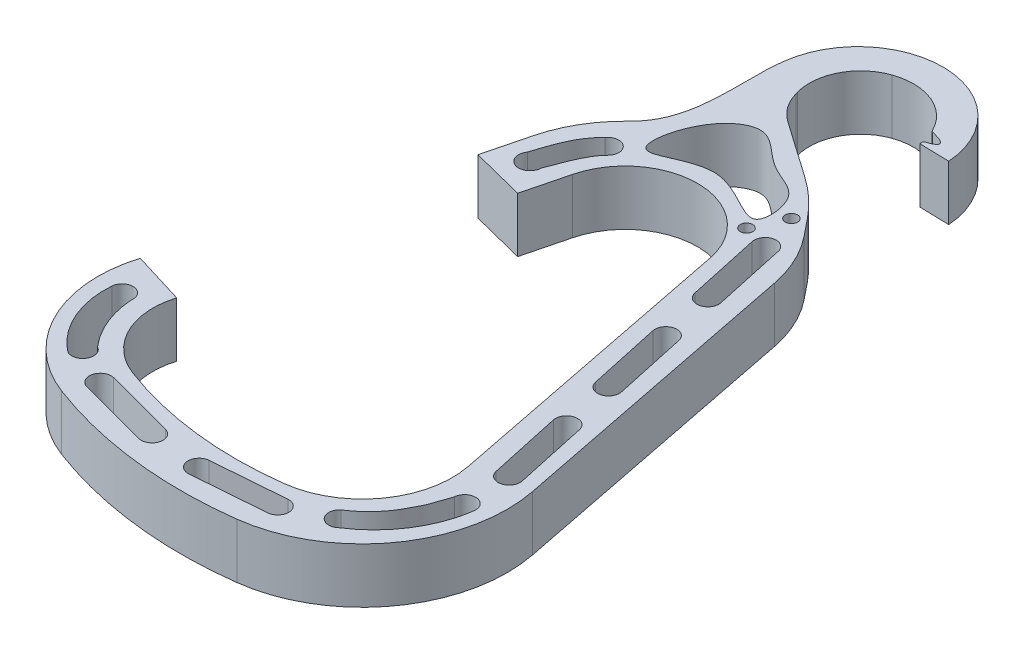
ISO-10303-21;
HEADER;
FILE_DESCRIPTION(('STEP AP214'),'2;1');
FILE_NAME('part.step','',(''),(''),'','','');
FILE_SCHEMA(('AUTOMOTIVE_DESIGN { 1 0 10303 214 1 1 1 1 }'));
ENDSEC;
DATA;
#1=APPLICATION_CONTEXT('core data for automotive mechanical design processes');
#2=APPLICATION_PROTOCOL_DEFINITION('international standard','automotive_design',2000,#1);
#3=PRODUCT_CONTEXT('',#1,'mechanical');
#4=PRODUCT('Part','Part','',(#3));
#5=PRODUCT_RELATED_PRODUCT_CATEGORY('part','',(#4));
#6=PRODUCT_DEFINITION_FORMATION('','',#4);
#7=PRODUCT_DEFINITION_CONTEXT('part definition',#1,'design');
#8=PRODUCT_DEFINITION('design','',#6,#7);
#9=PRODUCT_DEFINITION_SHAPE('','',#8);
#10=(LENGTH_UNIT() NAMED_UNIT(*) SI_UNIT(.MILLI.,.METRE.));
#11=(NAMED_UNIT(*) PLANE_ANGLE_UNIT() SI_UNIT($,.RADIAN.));
#12=(NAMED_UNIT(*) SI_UNIT($,.STERADIAN.) SOLID_ANGLE_UNIT());
#13=UNCERTAINTY_MEASURE_WITH_UNIT(LENGTH_MEASURE(1.E-05),#10,'distance_accuracy_value','');
#14=(GEOMETRIC_REPRESENTATION_CONTEXT(3) GLOBAL_UNCERTAINTY_ASSIGNED_CONTEXT((#13)) GLOBAL_UNIT_ASSIGNED_CONTEXT((#10,
#11,#12)) REPRESENTATION_CONTEXT('',''));
#15=CARTESIAN_POINT('',(0.,0.,0.));
#16=DIRECTION('',(0.,0.,1.));
#17=DIRECTION('',(1.,0.,0.));
#18=AXIS2_PLACEMENT_3D('',#15,#16,#17);
#19=CARTESIAN_POINT('',(11.6416763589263,9.525,-77.8397235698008));
#20=DIRECTION('',(0.,-1.,0.));
#21=DIRECTION('',(0.,0.,-1.));
#22=AXIS2_PLACEMENT_3D('',#19,#20,#21);
#23=CYLINDRICAL_SURFACE('',#22,9.63970531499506);
#24=CARTESIAN_POINT('',(11.6416763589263,0.,-77.8397235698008));
#25=DIRECTION('',(0.,1.,0.));
#26=DIRECTION('',(0.,0.,1.));
#27=AXIS2_PLACEMENT_3D('',#24,#25,#26);
#28=CIRCLE('',#27,9.63970531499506);
#29=CARTESIAN_POINT('',(8.45024697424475,0.,-86.9358049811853));
#30=VERTEX_POINT('',#29);
#31=CARTESIAN_POINT('',(20.3098299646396,0.,-82.0571910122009));
#32=VERTEX_POINT('',#31);
#33=EDGE_CURVE('E859',#30,#32,#28,.F.);
#34=ORIENTED_EDGE('',*,*,#33,.T.);
#35=DIRECTION('',(0.,-1.,0.));
#36=VECTOR('',#35,1.);
#37=CARTESIAN_POINT('',(20.3098299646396,9.525,-82.0571910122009));
#38=LINE('',#37,#36);
#39=CARTESIAN_POINT('',(20.3098299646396,9.525,-82.0571910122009));
#40=VERTEX_POINT('',#39);
#41=EDGE_CURVE('E971',#32,#40,#38,.F.);
#42=ORIENTED_EDGE('',*,*,#41,.T.);
#43=CARTESIAN_POINT('',(11.6416763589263,9.525,-77.8397235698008));
#44=DIRECTION('',(0.,1.,0.));
#45=DIRECTION('',(0.,0.,1.));
#46=AXIS2_PLACEMENT_3D('',#43,#44,#45);
#47=CIRCLE('',#46,9.63970531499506);
#48=CARTESIAN_POINT('',(8.45024697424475,9.525,-86.9358049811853));
#49=VERTEX_POINT('',#48);
#50=EDGE_CURVE('E998',#49,#40,#47,.F.);
#51=ORIENTED_EDGE('',*,*,#50,.F.);
#52=DIRECTION('',(0.,-1.,0.));
#53=VECTOR('',#52,1.);
#54=CARTESIAN_POINT('',(8.45024697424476,9.525,-86.9358049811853));
#55=LINE('',#54,#53);
#56=EDGE_CURVE('E944',#49,#30,#55,.T.);
#57=ORIENTED_EDGE('',*,*,#56,.T.);
#58=EDGE_LOOP('',(#34,#42,#51,#57));
#59=FACE_BOUND('',#58,.T.);
#60=ADVANCED_FACE('F35',(#59),#23,.F.);
#61=CARTESIAN_POINT('',(21.1503652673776,9.525,-79.4236281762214));
#62=VERTEX_POINT('',#61);
#63=CARTESIAN_POINT('',(21.2079178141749,9.525,-79.0275547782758));
#64=VERTEX_POINT('',#63);
#65=EDGE_CURVE('E1005',#62,#64,#47,.F.);
#66=ORIENTED_EDGE('',*,*,#65,.F.);
#67=DIRECTION('',(0.,-1.,0.));
#68=VECTOR('',#67,1.);
#69=CARTESIAN_POINT('',(21.1503652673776,9.525,-79.4236281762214));
#70=LINE('',#69,#68);
#71=CARTESIAN_POINT('',(21.1503652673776,0.,-79.4236281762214));
#72=VERTEX_POINT('',#71);
#73=EDGE_CURVE('E11',#62,#72,#70,.T.);
#74=ORIENTED_EDGE('',*,*,#73,.T.);
#75=CARTESIAN_POINT('',(21.2079178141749,0.,-79.0275547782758));
#76=VERTEX_POINT('',#75);
#77=EDGE_CURVE('E858',#72,#76,#28,.F.);
#78=ORIENTED_EDGE('',*,*,#77,.T.);
#79=DIRECTION('',(0.,-1.,0.));
#80=VECTOR('',#79,1.);
#81=CARTESIAN_POINT('',(21.2079178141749,9.525,-79.0275547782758));
#82=LINE('',#81,#80);
#83=EDGE_CURVE('E930',#64,#76,#82,.T.);
#84=ORIENTED_EDGE('',*,*,#83,.F.);
#85=EDGE_LOOP('',(#66,#74,#78,#84));
#86=FACE_BOUND('',#85,.T.);
#87=ADVANCED_FACE('F745',(#86),#23,.F.);
#88=CARTESIAN_POINT('',(-112.475715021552,9.525,-24.6585383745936));
#89=DIRECTION('',(0.,1.,0.));
#90=DIRECTION('',(0.,0.,1.));
#91=AXIS2_PLACEMENT_3D('',#88,#89,#90);
#92=PLANE('',#91);
#93=CARTESIAN_POINT('',(18.8206903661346,9.525,-51.3120345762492));
#94=DIRECTION('',(0.,1.,0.));
#95=DIRECTION('',(0.,0.,1.));
#96=AXIS2_PLACEMENT_3D('',#93,#94,#95);
#97=CIRCLE('',#96,1.0795);
#98=CARTESIAN_POINT('',(18.8206903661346,9.525,-50.2325345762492));
#99=VERTEX_POINT('',#98);
#100=EDGE_CURVE('E1745',#99,#99,#97,.T.);
#101=ORIENTED_EDGE('',*,*,#100,.F.);
#102=EDGE_LOOP('',(#101));
#103=FACE_BOUND('',#102,.T.);
#104=CARTESIAN_POINT('',(21.2894165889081,9.525,-56.6476686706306));
#105=DIRECTION('',(0.,1.,0.));
#106=DIRECTION('',(0.,0.,1.));
#107=AXIS2_PLACEMENT_3D('',#104,#105,#106);
#108=CIRCLE('',#107,1.0795);
#109=CARTESIAN_POINT('',(21.2894165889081,9.525,-55.5681686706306));
#110=VERTEX_POINT('',#109);
#111=EDGE_CURVE('E444',#110,#110,#108,.T.);
#112=ORIENTED_EDGE('',*,*,#111,.F.);
#113=EDGE_LOOP('',(#112));
#114=FACE_BOUND('',#113,.T.);
#115=CARTESIAN_POINT('',(-27.5058936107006,9.525,12.406625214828));
#116=CARTESIAN_POINT('',(-27.9490328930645,9.525,17.6842888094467));
#117=CARTESIAN_POINT('',(-25.5560987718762,9.525,23.0325805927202));
#118=CARTESIAN_POINT('',(-21.3525873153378,9.525,26.1957779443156));
#119=B_SPLINE_CURVE_WITH_KNOTS('',3,(#115,#116,#117,#118),.UNSPECIFIED.,.F.,.F.,(4,4),(0.,1.),.UNSPECIFIED.);
#120=CARTESIAN_POINT('',(-27.5058936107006,9.525,12.406625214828));
#121=VERTEX_POINT('',#120);
#122=CARTESIAN_POINT('',(-21.3525873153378,9.525,26.1957779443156));
#123=VERTEX_POINT('',#122);
#124=EDGE_CURVE('E50',#121,#123,#119,.T.);
#125=ORIENTED_EDGE('',*,*,#124,.F.);
#126=CARTESIAN_POINT('',(-25.6068026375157,9.525,12.5565534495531));
#127=DIRECTION('',(0.,1.,0.));
#128=DIRECTION('',(0.,0.,1.));
#129=AXIS2_PLACEMENT_3D('',#126,#127,#128);
#130=CIRCLE('',#129,1.905);
#131=CARTESIAN_POINT('',(-23.7077116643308,9.525,12.7064816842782));
#132=VERTEX_POINT('',#131);
#133=EDGE_CURVE('E435',#132,#121,#130,.T.);
#134=ORIENTED_EDGE('',*,*,#133,.F.);
#135=CARTESIAN_POINT('',(-19.6326059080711,9.525,22.7961067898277));
#136=CARTESIAN_POINT('',(-22.036192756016,9.525,19.9898159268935));
#137=CARTESIAN_POINT('',(-23.5489857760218,9.525,16.4031186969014));
#138=CARTESIAN_POINT('',(-23.7077116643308,9.525,12.7064816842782));
#139=B_SPLINE_CURVE_WITH_KNOTS('',3,(#135,#136,#137,#138),.UNSPECIFIED.,.F.,.F.,(4,4),(0.,1.),.UNSPECIFIED.);
#140=CARTESIAN_POINT('',(-19.6326059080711,9.525,22.7961067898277));
#141=VERTEX_POINT('',#140);
#142=EDGE_CURVE('E438',#141,#132,#139,.T.);
#143=ORIENTED_EDGE('',*,*,#142,.F.);
#144=CARTESIAN_POINT('',(-20.4925966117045,9.525,24.4959423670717));
#145=DIRECTION('',(0.,1.,0.));
#146=DIRECTION('',(0.,0.,1.));
#147=AXIS2_PLACEMENT_3D('',#144,#145,#146);
#148=CIRCLE('',#147,1.905);
#149=EDGE_CURVE('E1565',#123,#141,#148,.T.);
#150=ORIENTED_EDGE('',*,*,#149,.F.);
#151=EDGE_LOOP('',(#125,#134,#143,#150));
#152=FACE_BOUND('',#151,.T.);
#153=CARTESIAN_POINT('',(-1.79898168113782,9.525,31.1554221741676));
#154=DIRECTION('',(0.,1.,0.));
#155=DIRECTION('',(0.,0.,1.));
#156=AXIS2_PLACEMENT_3D('',#153,#154,#155);
#157=CIRCLE('',#156,1.905);
#158=CARTESIAN_POINT('',(-2.2900241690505,9.525,32.9960476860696));
#159=VERTEX_POINT('',#158);
#160=CARTESIAN_POINT('',(-1.30793919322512,9.525,29.3147966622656));
#161=VERTEX_POINT('',#160);
#162=EDGE_CURVE('E1580',#159,#161,#157,.T.);
#163=ORIENTED_EDGE('',*,*,#162,.F.);
#164=DIRECTION('',(0.966207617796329,0.,0.257765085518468));
#165=VECTOR('',#164,1.);
#166=CARTESIAN_POINT('',(-2.2900241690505,9.525,32.9960476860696));
#167=LINE('',#166,#165);
#168=CARTESIAN_POINT('',(-14.5608609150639,9.525,29.7224310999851));
#169=VERTEX_POINT('',#168);
#170=EDGE_CURVE('E1588',#169,#159,#167,.T.);
#171=ORIENTED_EDGE('',*,*,#170,.F.);
#172=CARTESIAN_POINT('',(-14.0698184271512,9.525,27.8818055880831));
#173=DIRECTION('',(0.,1.,0.));
#174=DIRECTION('',(0.,0.,1.));
#175=AXIS2_PLACEMENT_3D('',#172,#173,#174);
#176=CIRCLE('',#175,1.90499999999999);
#177=CARTESIAN_POINT('',(-13.5787759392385,9.525,26.0411800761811));
#178=VERTEX_POINT('',#177);
#179=EDGE_CURVE('E1602',#178,#169,#176,.T.);
#180=ORIENTED_EDGE('',*,*,#179,.F.);
#181=DIRECTION('',(-0.966207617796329,0.,-0.257765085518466));
#182=VECTOR('',#181,1.);
#183=CARTESIAN_POINT('',(-1.30793919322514,9.525,29.3147966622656));
#184=LINE('',#183,#182);
#185=EDGE_CURVE('E1599',#161,#178,#184,.T.);
#186=ORIENTED_EDGE('',*,*,#185,.F.);
#187=EDGE_LOOP('',(#163,#171,#180,#186));
#188=FACE_BOUND('',#187,.T.);
#189=CARTESIAN_POINT('',(19.9200791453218,9.525,31.0873629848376));
#190=DIRECTION('',(0.,1.,0.));
#191=DIRECTION('',(0.,0.,1.));
#192=AXIS2_PLACEMENT_3D('',#189,#190,#191);
#193=CIRCLE('',#192,1.90500000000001);
#194=CARTESIAN_POINT('',(20.0685996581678,9.525,32.9865645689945));
#195=VERTEX_POINT('',#194);
#196=CARTESIAN_POINT('',(19.7715586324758,9.525,29.1881614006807));
#197=VERTEX_POINT('',#196);
#198=EDGE_CURVE('E1609',#195,#197,#193,.T.);
#199=ORIENTED_EDGE('',*,*,#198,.F.);
#200=DIRECTION('',(0.996956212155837,0.,-0.0779635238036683));
#201=VECTOR('',#200,1.);
#202=CARTESIAN_POINT('',(20.0685996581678,9.525,32.9865645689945));
#203=LINE('',#202,#201);
#204=CARTESIAN_POINT('',(7.40725576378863,9.525,33.9767013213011));
#205=VERTEX_POINT('',#204);
#206=EDGE_CURVE('E1620',#205,#195,#203,.T.);
#207=ORIENTED_EDGE('',*,*,#206,.F.);
#208=CARTESIAN_POINT('',(7.25873525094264,9.525,32.0774997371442));
#209=DIRECTION('',(0.,1.,0.));
#210=DIRECTION('',(0.,0.,1.));
#211=AXIS2_PLACEMENT_3D('',#208,#209,#210);
#212=CIRCLE('',#211,1.905);
#213=CARTESIAN_POINT('',(7.11021473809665,9.525,30.1782981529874));
#214=VERTEX_POINT('',#213);
#215=EDGE_CURVE('E1634',#214,#205,#212,.T.);
#216=ORIENTED_EDGE('',*,*,#215,.F.);
#217=DIRECTION('',(-0.996956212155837,0.,0.0779635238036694));
#218=VECTOR('',#217,1.);
#219=CARTESIAN_POINT('',(19.7715586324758,9.525,29.1881614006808));
#220=LINE('',#219,#218);
#221=EDGE_CURVE('E1631',#197,#214,#220,.T.);
#222=ORIENTED_EDGE('',*,*,#221,.F.);
#223=EDGE_LOOP('',(#199,#207,#216,#222));
#224=FACE_BOUND('',#223,.T.);
#225=CARTESIAN_POINT('',(28.5382695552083,9.525,29.0127256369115));
#226=CARTESIAN_POINT('',(33.4547711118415,9.525,25.8836498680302));
#227=CARTESIAN_POINT('',(36.9795959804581,9.525,20.4202969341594));
#228=CARTESIAN_POINT('',(37.6703699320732,9.525,14.6197995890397));
#229=B_SPLINE_CURVE_WITH_KNOTS('',3,(#225,#226,#227,#228),.UNSPECIFIED.,.F.,.F.,(4,4),(0.,1.),.UNSPECIFIED.);
#230=CARTESIAN_POINT('',(28.5382695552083,9.525,29.0127256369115));
#231=VERTEX_POINT('',#230);
#232=CARTESIAN_POINT('',(37.6703699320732,9.525,14.6197995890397));
#233=VERTEX_POINT('',#232);
#234=EDGE_CURVE('E516',#231,#233,#229,.T.);
#235=ORIENTED_EDGE('',*,*,#234,.F.);
#236=CARTESIAN_POINT('',(27.2170825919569,9.525,27.6393339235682));
#237=DIRECTION('',(0.,1.,0.));
#238=DIRECTION('',(0.,0.,1.));
#239=AXIS2_PLACEMENT_3D('',#236,#237,#238);
#240=CIRCLE('',#239,1.9057124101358);
#241=CARTESIAN_POINT('',(25.9729419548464,9.525,26.1957779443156));
#242=VERTEX_POINT('',#241);
#243=EDGE_CURVE('E532',#242,#231,#240,.T.);
#244=ORIENTED_EDGE('',*,*,#243,.F.);
#245=CARTESIAN_POINT('',(33.8666371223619,9.525,14.4013580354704));
#246=CARTESIAN_POINT('',(32.6070876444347,9.525,18.2963923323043));
#247=CARTESIAN_POINT('',(32.0979294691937,9.525,18.4831022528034));
#248=CARTESIAN_POINT('',(30.2603283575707,9.525,23.45154092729));
#249=CARTESIAN_POINT('',(25.9729419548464,9.525,26.1957779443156));
#250=B_SPLINE_CURVE_WITH_KNOTS('',3,(#245,#246,#247,#248,#249),.UNSPECIFIED.,.F.,.F.,(4,1,4),
(0.,0.31891643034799,1.),.UNSPECIFIED.);
#251=CARTESIAN_POINT('',(33.8666371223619,9.525,14.4013580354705));
#252=VERTEX_POINT('',#251);
#253=EDGE_CURVE('E527',#252,#242,#250,.T.);
#254=ORIENTED_EDGE('',*,*,#253,.F.);
#255=CARTESIAN_POINT('',(35.7685035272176,9.525,14.5105788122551));
#256=DIRECTION('',(0.,1.,0.));
#257=DIRECTION('',(0.,0.,1.));
#258=AXIS2_PLACEMENT_3D('',#255,#256,#257);
#259=CIRCLE('',#258,1.905);
#260=EDGE_CURVE('E520',#233,#252,#259,.T.);
#261=ORIENTED_EDGE('',*,*,#260,.F.);
#262=EDGE_LOOP('',(#235,#244,#254,#261));
#263=FACE_BOUND('',#262,.T.);
#264=CARTESIAN_POINT('',(-1.79898168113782,9.525,-54.4899903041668));
#265=CARTESIAN_POINT('',(-0.353217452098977,9.525,-53.4603183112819));
#266=CARTESIAN_POINT('',(8.29605269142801,9.525,-61.0856121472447));
#267=CARTESIAN_POINT('',(19.7375003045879,9.525,-49.197085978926));
#268=CARTESIAN_POINT('',(18.670778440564,9.525,-61.1709083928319));
#269=CARTESIAN_POINT('',(11.4714684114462,9.525,-62.1507070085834));
#270=CARTESIAN_POINT('',(6.27693701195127,9.525,-69.1472984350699));
#271=CARTESIAN_POINT('',(-1.51619606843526,9.525,-63.9490395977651));
#272=CARTESIAN_POINT('',(-3.12663218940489,9.525,-55.4355418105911));
#273=CARTESIAN_POINT('',(-1.79898168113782,9.525,-54.4899903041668));
#274=B_SPLINE_CURVE_WITH_KNOTS('',3,(#264,#265,#266,#267,#268,#269,#270,#271,#272,#273),
.UNSPECIFIED.,.T.,.F.,(4,1,1,1,1,1,1,4),(0.,0.175121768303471,0.368271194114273,
0.466833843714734,0.586943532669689,0.718963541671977,0.839185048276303,1.),.UNSPECIFIED.);
#275=CARTESIAN_POINT('',(-1.79898168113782,9.525,-54.4899903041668));
#276=VERTEX_POINT('',#275);
#277=EDGE_CURVE('E541',#276,#276,#274,.T.);
#278=ORIENTED_EDGE('',*,*,#277,.F.);
#279=EDGE_LOOP('',(#278));
#280=FACE_BOUND('',#279,.T.);
#281=CARTESIAN_POINT('',(-7.03726846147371,9.525,-52.6577355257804));
#282=CARTESIAN_POINT('',(-9.56617539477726,9.525,-50.2873693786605));
#283=CARTESIAN_POINT('',(-10.5746738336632,9.525,-46.920122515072));
#284=CARTESIAN_POINT('',(-11.6001126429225,9.525,-43.7115793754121));
#285=B_SPLINE_CURVE_WITH_KNOTS('',3,(#281,#282,#283,#284),.UNSPECIFIED.,.F.,.F.,(4,4),(0.,1.),.UNSPECIFIED.);
#286=CARTESIAN_POINT('',(-7.03726846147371,9.525,-52.6577355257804));
#287=VERTEX_POINT('',#286);
#288=CARTESIAN_POINT('',(-11.6001126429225,9.525,-43.7115793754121));
#289=VERTEX_POINT('',#288);
#290=EDGE_CURVE('E554',#287,#289,#285,.T.);
#291=ORIENTED_EDGE('',*,*,#290,.F.);
#292=CARTESIAN_POINT('',(-5.48254273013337,9.525,-51.5568936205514));
#293=DIRECTION('',(0.,1.,0.));
#294=DIRECTION('',(0.,0.,1.));
#295=AXIS2_PLACEMENT_3D('',#292,#293,#294);
#296=CIRCLE('',#295,1.905);
#297=CARTESIAN_POINT('',(-3.92781699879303,9.525,-50.4560517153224));
#298=VERTEX_POINT('',#297);
#299=EDGE_CURVE('E607',#298,#287,#296,.T.);
#300=ORIENTED_EDGE('',*,*,#299,.F.);
#301=CARTESIAN_POINT('',(-7.97341398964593,9.525,-42.5440362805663));
#302=CARTESIAN_POINT('',(-6.84402137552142,9.525,-45.2938576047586));
#303=CARTESIAN_POINT('',(-6.10878948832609,9.525,-48.2706862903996));
#304=CARTESIAN_POINT('',(-3.92781699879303,9.525,-50.4560517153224));
#305=B_SPLINE_CURVE_WITH_KNOTS('',3,(#301,#302,#303,#304),.UNSPECIFIED.,.F.,.F.,(4,4),(0.,1.),.UNSPECIFIED.);
#306=CARTESIAN_POINT('',(-7.97341398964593,9.525,-42.5440362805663));
#307=VERTEX_POINT('',#306);
#308=EDGE_CURVE('E602',#307,#298,#305,.T.);
#309=ORIENTED_EDGE('',*,*,#308,.F.);
#310=CARTESIAN_POINT('',(-9.96850818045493,9.525,-42.5632600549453));
#311=DIRECTION('',(0.,1.,0.));
#312=DIRECTION('',(0.,0.,1.));
#313=AXIS2_PLACEMENT_3D('',#310,#311,#312);
#314=CIRCLE('',#313,1.99518680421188);
#315=EDGE_CURVE('E596',#289,#307,#314,.T.);
#316=ORIENTED_EDGE('',*,*,#315,.F.);
#317=EDGE_LOOP('',(#291,#300,#309,#316));
#318=FACE_BOUND('',#317,.T.);
#319=CARTESIAN_POINT('',(32.7554046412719,9.525,-6.15770436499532));
#320=DIRECTION('',(0.,1.,0.));
#321=DIRECTION('',(0.,0.,1.));
#322=AXIS2_PLACEMENT_3D('',#319,#320,#321);
#323=CIRCLE('',#322,1.905);
#324=CARTESIAN_POINT('',(34.6171032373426,9.525,-6.56156490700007));
#325=VERTEX_POINT('',#324);
#326=CARTESIAN_POINT('',(30.8937060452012,9.525,-5.75384382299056));
#327=VERTEX_POINT('',#326);
#328=EDGE_CURVE('E616',#325,#327,#323,.T.);
#329=ORIENTED_EDGE('',*,*,#328,.F.);
#330=DIRECTION('',(-0.212000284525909,0.,-0.977269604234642));
#331=VECTOR('',#330,1.);
#332=CARTESIAN_POINT('',(34.6171032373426,9.525,-6.56156490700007));
#333=LINE('',#332,#331);
#334=CARTESIAN_POINT('',(37.3721296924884,9.525,6.13843509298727));
#335=VERTEX_POINT('',#334);
#336=EDGE_CURVE('E627',#335,#325,#333,.T.);
#337=ORIENTED_EDGE('',*,*,#336,.F.);
#338=CARTESIAN_POINT('',(35.5104310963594,9.525,6.54229563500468));
#339=DIRECTION('',(0.,1.,0.));
#340=DIRECTION('',(0.,0.,1.));
#341=AXIS2_PLACEMENT_3D('',#338,#339,#340);
#342=CIRCLE('',#341,1.90500000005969);
#343=CARTESIAN_POINT('',(33.6487325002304,9.525,6.94615617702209));
#344=VERTEX_POINT('',#343);
#345=EDGE_CURVE('E641',#344,#335,#342,.T.);
#346=ORIENTED_EDGE('',*,*,#345,.F.);
#347=DIRECTION('',(0.212000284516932,0.,0.977269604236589));
#348=VECTOR('',#347,1.);
#349=CARTESIAN_POINT('',(30.8937060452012,9.525,-5.75384382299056));
#350=LINE('',#349,#348);
#351=EDGE_CURVE('E638',#327,#344,#350,.T.);
#352=ORIENTED_EDGE('',*,*,#351,.F.);
#353=EDGE_LOOP('',(#329,#337,#346,#352));
#354=FACE_BOUND('',#353,.T.);
#355=CARTESIAN_POINT('',(27.9810754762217,9.525,-28.1661973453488));
#356=DIRECTION('',(0.,1.,0.));
#357=DIRECTION('',(0.,0.,1.));
#358=AXIS2_PLACEMENT_3D('',#355,#356,#357);
#359=CIRCLE('',#358,1.90500000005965);
#360=CARTESIAN_POINT('',(29.842774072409,9.525,-28.5700578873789));
#361=VERTEX_POINT('',#360);
#362=CARTESIAN_POINT('',(26.119376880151,9.525,-27.7623368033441));
#363=VERTEX_POINT('',#362);
#364=EDGE_CURVE('E648',#361,#363,#359,.T.);
#365=ORIENTED_EDGE('',*,*,#364,.F.);
#366=DIRECTION('',(-0.212000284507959,0.,-0.977269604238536));
#367=VECTOR('',#366,1.);
#368=CARTESIAN_POINT('',(29.842774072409,9.525,-28.5700578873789));
#369=LINE('',#368,#367);
#370=CARTESIAN_POINT('',(32.5978005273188,9.525,-15.8700578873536));
#371=VERTEX_POINT('',#370);
#372=EDGE_CURVE('E659',#371,#361,#369,.T.);
#373=ORIENTED_EDGE('',*,*,#372,.F.);
#374=CARTESIAN_POINT('',(30.7361019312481,9.525,-15.4661973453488));
#375=DIRECTION('',(0.,1.,0.));
#376=DIRECTION('',(0.,0.,1.));
#377=AXIS2_PLACEMENT_3D('',#374,#375,#376);
#378=CIRCLE('',#377,1.905);
#379=CARTESIAN_POINT('',(28.8744033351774,9.525,-15.0623368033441));
#380=VERTEX_POINT('',#379);
#381=EDGE_CURVE('E673',#380,#371,#378,.T.);
#382=ORIENTED_EDGE('',*,*,#381,.F.);
#383=DIRECTION('',(0.212000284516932,0.,0.977269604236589));
#384=VECTOR('',#383,1.);
#385=CARTESIAN_POINT('',(26.119376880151,9.525,-27.7623368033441));
#386=LINE('',#385,#384);
#387=EDGE_CURVE('E670',#363,#380,#386,.T.);
#388=ORIENTED_EDGE('',*,*,#387,.F.);
#389=EDGE_LOOP('',(#365,#373,#382,#388));
#390=FACE_BOUND('',#389,.T.);
#391=CARTESIAN_POINT('',(23.2067463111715,9.525,-50.1746903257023));
#392=DIRECTION('',(0.,1.,0.));
#393=DIRECTION('',(0.,0.,1.));
#394=AXIS2_PLACEMENT_3D('',#391,#392,#393);
#395=CIRCLE('',#394,1.90500000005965);
#396=CARTESIAN_POINT('',(25.0684449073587,9.525,-50.5785508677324));
#397=VERTEX_POINT('',#396);
#398=CARTESIAN_POINT('',(21.3450477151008,9.525,-49.7708297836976));
#399=VERTEX_POINT('',#398);
#400=EDGE_CURVE('E680',#397,#399,#395,.T.);
#401=ORIENTED_EDGE('',*,*,#400,.F.);
#402=DIRECTION('',(-0.212000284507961,0.,-0.977269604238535));
#403=VECTOR('',#402,1.);
#404=CARTESIAN_POINT('',(25.0684449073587,9.525,-50.5785508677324));
#405=LINE('',#404,#403);
#406=CARTESIAN_POINT('',(27.8234713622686,9.525,-37.8785508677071));
#407=VERTEX_POINT('',#406);
#408=EDGE_CURVE('E691',#407,#397,#405,.T.);
#409=ORIENTED_EDGE('',*,*,#408,.F.);
#410=CARTESIAN_POINT('',(25.9617727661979,9.525,-37.4746903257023));
#411=DIRECTION('',(0.,1.,0.));
#412=DIRECTION('',(0.,0.,1.));
#413=AXIS2_PLACEMENT_3D('',#410,#411,#412);
#414=CIRCLE('',#413,1.905);
#415=CARTESIAN_POINT('',(24.1000741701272,9.525,-37.0708297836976));
#416=VERTEX_POINT('',#415);
#417=EDGE_CURVE('E705',#416,#407,#414,.T.);
#418=ORIENTED_EDGE('',*,*,#417,.F.);
#419=DIRECTION('',(0.212000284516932,0.,0.977269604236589));
#420=VECTOR('',#419,1.);
#421=CARTESIAN_POINT('',(21.3450477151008,9.525,-49.7708297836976));
#422=LINE('',#421,#420);
#423=EDGE_CURVE('E702',#399,#416,#422,.T.);
#424=ORIENTED_EDGE('',*,*,#423,.F.);
#425=EDGE_LOOP('',(#401,#409,#418,#424));
#426=FACE_BOUND('',#425,.T.);
#427=ORIENTED_EDGE('',*,*,#50,.T.);
#428=CARTESIAN_POINT('',(20.5382302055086,9.525,-82.1683185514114));
#429=DIRECTION('',(0.,1.,0.));
#430=DIRECTION('',(0.,0.,1.));
#431=AXIS2_PLACEMENT_3D('',#428,#429,#430);
#432=CIRCLE('',#431,0.254);
#433=CARTESIAN_POINT('',(20.4771288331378,9.525,-81.9217772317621));
#434=VERTEX_POINT('',#433);
#435=EDGE_CURVE('E976',#40,#434,#432,.T.);
#436=ORIENTED_EDGE('',*,*,#435,.T.);
#437=CARTESIAN_POINT('',(20.3610728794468,9.525,-81.9502032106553));
#438=CARTESIAN_POINT('',(25.07966438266,9.525,-80.8078368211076));
#439=CARTESIAN_POINT('',(21.1112026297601,9.525,-79.6430512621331));
#440=B_SPLINE_CURVE_WITH_KNOTS('',2,(#437,#438,#439),.UNSPECIFIED.,.F.,.F.,(3,3),(0.,1.),.UNSPECIFIED.);
#441=CARTESIAN_POINT('',(21.325180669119,9.525,-79.7078101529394));
#442=VERTEX_POINT('',#441);
#443=EDGE_CURVE('E712',#434,#442,#440,.T.);
#444=ORIENTED_EDGE('',*,*,#443,.T.);
#445=CARTESIAN_POINT('',(21.4009130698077,9.525,-79.4653630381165));
#446=DIRECTION('',(0.,1.,0.));
#447=DIRECTION('',(0.,0.,1.));
#448=AXIS2_PLACEMENT_3D('',#445,#446,#447);
#449=CIRCLE('',#448,0.254);
#450=EDGE_CURVE('E974',#442,#62,#449,.T.);
#451=ORIENTED_EDGE('',*,*,#450,.T.);
#452=ORIENTED_EDGE('',*,*,#65,.T.);
#453=DIRECTION('',(-0.999646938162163,0.,-0.0265706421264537));
#454=VECTOR('',#453,1.);
#455=CARTESIAN_POINT('',(-110.937224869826,9.525,-82.5399761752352));
#456=LINE('',#455,#454);
#457=CARTESIAN_POINT('',(26.3237515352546,9.525,-78.8915757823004));
#458=VERTEX_POINT('',#457);
#459=EDGE_CURVE('E1012',#458,#64,#456,.T.);
#460=ORIENTED_EDGE('',*,*,#459,.F.);
#461=CARTESIAN_POINT('',(11.6416763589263,9.525,-77.8397235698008));
#462=DIRECTION('',(0.,1.,0.));
#463=DIRECTION('',(0.,0.,1.));
#464=AXIS2_PLACEMENT_3D('',#461,#462,#463);
#465=CIRCLE('',#464,14.7197053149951);
#466=CARTESIAN_POINT('',(-2.9637907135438,9.525,-79.6700394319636));
#467=VERTEX_POINT('',#466);
#468=EDGE_CURVE('E808',#467,#458,#465,.F.);
#469=ORIENTED_EDGE('',*,*,#468,.F.);
#470=CARTESIAN_POINT('',(-7.4009147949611,9.525,-57.2051869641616));
#471=CARTESIAN_POINT('',(-1.49507512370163,9.525,-62.8446280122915));
#472=CARTESIAN_POINT('',(-3.98091476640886,9.525,-73.1575646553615));
#473=CARTESIAN_POINT('',(-2.9637907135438,9.525,-79.6700394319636));
#474=B_SPLINE_CURVE_WITH_KNOTS('',3,(#470,#471,#472,#473),.UNSPECIFIED.,.F.,.F.,(4,4),(0.,1.),.UNSPECIFIED.);
#475=CARTESIAN_POINT('',(-7.4009147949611,9.525,-57.2051869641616));
#476=VERTEX_POINT('',#475);
#477=EDGE_CURVE('E800',#476,#467,#474,.T.);
#478=ORIENTED_EDGE('',*,*,#477,.F.);
#479=CARTESIAN_POINT('',(7.84740321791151,9.525,-41.2365615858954));
#480=DIRECTION('',(0.,1.,0.));
#481=DIRECTION('',(0.,0.,1.));
#482=AXIS2_PLACEMENT_3D('',#479,#480,#481);
#483=CIRCLE('',#482,22.0795878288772);
#484=CARTESIAN_POINT('',(-13.5558512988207,9.525,-46.6595584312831));
#485=VERTEX_POINT('',#484);
#486=EDGE_CURVE('E807',#476,#485,#483,.T.);
#487=ORIENTED_EDGE('',*,*,#486,.T.);
#488=DIRECTION('',(-0.245611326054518,0.,0.969368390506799));
#489=VECTOR('',#488,1.);
#490=CARTESIAN_POINT('',(-24.7613602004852,9.525,-2.43412997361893));
#491=LINE('',#490,#489);
#492=CARTESIAN_POINT('',(-15.4862842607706,9.525,-39.0406072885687));
#493=VERTEX_POINT('',#492);
#494=EDGE_CURVE('E810',#485,#493,#491,.T.);
#495=ORIENTED_EDGE('',*,*,#494,.T.);
#496=DIRECTION('',(0.969368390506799,0.,0.245611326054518));
#497=VECTOR('',#496,1.);
#498=CARTESIAN_POINT('',(-103.200639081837,9.525,-61.2650156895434));
#499=LINE('',#498,#497);
#500=CARTESIAN_POINT('',(-6.25305034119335,9.525,-36.7011594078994));
#501=VERTEX_POINT('',#500);
#502=EDGE_CURVE('E815',#493,#501,#499,.T.);
#503=ORIENTED_EDGE('',*,*,#502,.T.);
#504=DIRECTION('',(-0.245611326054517,0.,0.969368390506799));
#505=VECTOR('',#504,1.);
#506=CARTESIAN_POINT('',(-15.5281262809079,9.525,-0.0946820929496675));
#507=LINE('',#506,#505);
#508=CARTESIAN_POINT('',(-4.32261737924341,9.525,-44.3201105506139));
#509=VERTEX_POINT('',#508);
#510=EDGE_CURVE('E817',#509,#501,#507,.T.);
#511=ORIENTED_EDGE('',*,*,#510,.F.);
#512=CARTESIAN_POINT('',(7.84740321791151,9.525,-41.2365615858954));
#513=DIRECTION('',(0.,1.,0.));
#514=DIRECTION('',(0.,0.,1.));
#515=AXIS2_PLACEMENT_3D('',#512,#513,#514);
#516=CIRCLE('',#515,12.5545878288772);
#517=CARTESIAN_POINT('',(20.1640456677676,9.525,-43.6692543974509));
#518=VERTEX_POINT('',#517);
#519=EDGE_CURVE('E820',#518,#509,#516,.T.);
#520=ORIENTED_EDGE('',*,*,#519,.F.);
#521=DIRECTION('',(0.19376922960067,0.,0.981047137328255));
#522=VECTOR('',#521,1.);
#523=CARTESIAN_POINT('',(18.7977602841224,9.525,-50.5867116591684));
#524=LINE('',#523,#522);
#525=CARTESIAN_POINT('',(30.4996963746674,9.525,8.65979990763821));
#526=VERTEX_POINT('',#525);
#527=EDGE_CURVE('E823',#518,#526,#524,.T.);
#528=ORIENTED_EDGE('',*,*,#527,.T.);
#529=CARTESIAN_POINT('',(15.1965110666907,9.525,11.6823727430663));
#530=DIRECTION('',(0.,1.,0.));
#531=DIRECTION('',(0.,0.,1.));
#532=AXIS2_PLACEMENT_3D('',#529,#530,#531);
#533=CIRCLE('',#532,15.5988277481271);
#534=CARTESIAN_POINT('',(17.1892058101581,9.525,27.1533971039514));
#535=VERTEX_POINT('',#534);
#536=EDGE_CURVE('E825',#526,#535,#533,.F.);
#537=ORIENTED_EDGE('',*,*,#536,.T.);
#538=CARTESIAN_POINT('',(9.25573045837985,9.525,-34.441079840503));
#539=DIRECTION('',(0.,1.,0.));
#540=DIRECTION('',(0.,0.,1.));
#541=AXIS2_PLACEMENT_3D('',#538,#539,#540);
#542=CIRCLE('',#541,62.1032979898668);
#543=CARTESIAN_POINT('',(-12.7287133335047,9.525,23.6407921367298));
#544=VERTEX_POINT('',#543);
#545=EDGE_CURVE('E827',#535,#544,#542,.F.);
#546=ORIENTED_EDGE('',*,*,#545,.T.);
#547=CARTESIAN_POINT('',(-8.38825804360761,9.525,12.1735123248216));
#548=DIRECTION('',(0.,1.,0.));
#549=DIRECTION('',(0.,0.,1.));
#550=AXIS2_PLACEMENT_3D('',#547,#548,#549);
#551=CIRCLE('',#550,12.2612421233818);
#552=CARTESIAN_POINT('',(-20.1127138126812,9.525,8.58531008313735));
#553=VERTEX_POINT('',#552);
#554=EDGE_CURVE('E829',#544,#553,#551,.F.);
#555=ORIENTED_EDGE('',*,*,#554,.T.);
#556=DIRECTION('',(0.956220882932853,0.,0.29264590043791));
#557=VECTOR('',#556,1.);
#558=CARTESIAN_POINT('',(-113.868360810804,9.525,-20.1080663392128));
#559=LINE('',#558,#557);
#560=CARTESIAN_POINT('',(-29.2207177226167,9.525,5.79785788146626));
#561=VERTEX_POINT('',#560);
#562=EDGE_CURVE('E831',#561,#553,#559,.T.);
#563=ORIENTED_EDGE('',*,*,#562,.F.);
#564=CARTESIAN_POINT('',(-8.38825804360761,9.525,12.1735123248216));
#565=DIRECTION('',(0.,1.,0.));
#566=DIRECTION('',(0.,0.,1.));
#567=AXIS2_PLACEMENT_3D('',#564,#565,#566);
#568=CIRCLE('',#567,21.7862421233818);
#569=CARTESIAN_POINT('',(-16.1005443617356,9.525,32.5490119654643));
#570=VERTEX_POINT('',#569);
#571=EDGE_CURVE('E899',#570,#561,#568,.F.);
#572=ORIENTED_EDGE('',*,*,#571,.F.);
#573=CARTESIAN_POINT('',(9.25573045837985,9.525,-34.441079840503));
#574=DIRECTION('',(0.,1.,0.));
#575=DIRECTION('',(0.,0.,1.));
#576=AXIS2_PLACEMENT_3D('',#573,#574,#575);
#577=CIRCLE('',#576,71.6282979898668);
#578=CARTESIAN_POINT('',(18.4059906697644,9.525,36.6003574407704));
#579=VERTEX_POINT('',#578);
#580=EDGE_CURVE('E1044',#579,#570,#577,.F.);
#581=ORIENTED_EDGE('',*,*,#580,.F.);
#582=CARTESIAN_POINT('',(15.1965110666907,9.525,11.6823727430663));
#583=DIRECTION('',(0.,1.,0.));
#584=DIRECTION('',(0.,0.,1.));
#585=AXIS2_PLACEMENT_3D('',#582,#583,#584);
#586=CIRCLE('',#585,25.1238277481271);
#587=CARTESIAN_POINT('',(39.844170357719,9.525,6.81414799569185));
#588=VERTEX_POINT('',#587);
#589=EDGE_CURVE('E1041',#588,#579,#586,.F.);
#590=ORIENTED_EDGE('',*,*,#589,.F.);
#591=DIRECTION('',(0.19376922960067,0.,0.981047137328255));
#592=VECTOR('',#591,1.);
#593=CARTESIAN_POINT('',(28.1422342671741,9.525,-52.4323635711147));
#594=LINE('',#593,#592);
#595=CARTESIAN_POINT('',(29.5085196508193,9.525,-45.5149063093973));
#596=VERTEX_POINT('',#595);
#597=EDGE_CURVE('E1035',#596,#588,#594,.T.);
#598=ORIENTED_EDGE('',*,*,#597,.F.);
#599=CARTESIAN_POINT('',(25.0451520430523,9.525,-55.0837863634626));
#600=VERTEX_POINT('',#599);
#601=EDGE_CURVE('E1030',#596,#600,#483,.T.);
#602=ORIENTED_EDGE('',*,*,#601,.T.);
#603=DIRECTION('',(0.627150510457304,0.,0.778898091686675));
#604=VECTOR('',#603,1.);
#605=CARTESIAN_POINT('',(-14.1819298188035,9.525,-103.802393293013));
#606=LINE('',#605,#604);
#607=CARTESIAN_POINT('',(22.7514014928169,9.525,-57.932541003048));
#608=VERTEX_POINT('',#607);
#609=EDGE_CURVE('E1034',#608,#600,#606,.T.);
#610=ORIENTED_EDGE('',*,*,#609,.F.);
#611=CARTESIAN_POINT('',(-1.97861291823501,9.525,-38.0205122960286));
#612=DIRECTION('',(0.,1.,0.));
#613=DIRECTION('',(0.,0.,1.));
#614=AXIS2_PLACEMENT_3D('',#611,#612,#613);
#615=CIRCLE('',#614,31.75);
#616=CARTESIAN_POINT('',(16.2144788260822,9.525,-64.041156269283));
#617=VERTEX_POINT('',#616);
#618=EDGE_CURVE('E969',#608,#617,#615,.T.);
#619=ORIENTED_EDGE('',*,*,#618,.T.);
#620=DIRECTION('',(0.819547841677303,0.,0.573010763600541));
#621=VECTOR('',#620,1.);
#622=CARTESIAN_POINT('',(-51.7269442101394,9.525,-111.54438270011));
#623=LINE('',#622,#621);
#624=CARTESIAN_POINT('',(6.4012759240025,9.525,-70.9023431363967));
#625=VERTEX_POINT('',#624);
#626=EDGE_CURVE('E1014',#625,#617,#623,.T.);
#627=ORIENTED_EDGE('',*,*,#626,.F.);
#628=CARTESIAN_POINT('',(11.4953416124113,9.525,-78.1881234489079));
#629=DIRECTION('',(0.,1.,0.));
#630=DIRECTION('',(0.,0.,1.));
#631=AXIS2_PLACEMENT_3D('',#628,#629,#630);
#632=CIRCLE('',#631,8.89);
#633=CARTESIAN_POINT('',(2.94295403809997,9.525,-75.7614453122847));
#634=VERTEX_POINT('',#633);
#635=EDGE_CURVE('E960',#625,#634,#632,.F.);
#636=ORIENTED_EDGE('',*,*,#635,.T.);
#637=DIRECTION('',(0.272967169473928,0.,0.962023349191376));
#638=VECTOR('',#637,1.);
#639=CARTESIAN_POINT('',(7.76264862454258,9.525,-58.7753046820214));
#640=LINE('',#639,#638);
#641=CARTESIAN_POINT('',(2.84108290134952,9.525,-76.1204716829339));
#642=VERTEX_POINT('',#641);
#643=EDGE_CURVE('E1010',#642,#634,#640,.T.);
#644=ORIENTED_EDGE('',*,*,#643,.F.);
#645=CARTESIAN_POINT('',(11.3934704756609,9.525,-78.5471498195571));
#646=DIRECTION('',(0.,1.,0.));
#647=DIRECTION('',(0.,0.,1.));
#648=AXIS2_PLACEMENT_3D('',#645,#646,#647);
#649=CIRCLE('',#648,8.89);
#650=EDGE_CURVE('E956',#642,#49,#649,.F.);
#651=ORIENTED_EDGE('',*,*,#650,.T.);
#652=EDGE_LOOP('',(#427,#436,#444,#451,#452,#460,#469,#478,#487,#495,#503,#511,#520,#528,#537,
#546,#555,#563,#572,#581,#590,#598,#602,#610,#619,#627,#636,#644,#651));
#653=FACE_BOUND('',#652,.T.);
#654=ADVANCED_FACE('F742',(#103,#114,#152,#188,#224,#263,#280,#318,#354,#390,#426,#653),#92,.T.);
#655=CARTESIAN_POINT('',(-112.475715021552,0.,-24.6585383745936));
#656=DIRECTION('',(0.,1.,0.));
#657=DIRECTION('',(0.,0.,1.));
#658=AXIS2_PLACEMENT_3D('',#655,#656,#657);
#659=PLANE('',#658);
#660=CARTESIAN_POINT('',(18.8206903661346,0.,-51.3120345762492));
#661=DIRECTION('',(0.,1.,0.));
#662=DIRECTION('',(0.,0.,1.));
#663=AXIS2_PLACEMENT_3D('',#660,#661,#662);
#664=CIRCLE('',#663,1.0795);
#665=CARTESIAN_POINT('',(18.8206903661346,0.,-50.2325345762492));
#666=VERTEX_POINT('',#665);
#667=EDGE_CURVE('E1743',#666,#666,#664,.T.);
#668=ORIENTED_EDGE('',*,*,#667,.T.);
#669=EDGE_LOOP('',(#668));
#670=FACE_BOUND('',#669,.T.);
#671=CARTESIAN_POINT('',(21.2894165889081,0.,-56.6476686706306));
#672=DIRECTION('',(0.,1.,0.));
#673=DIRECTION('',(0.,0.,1.));
#674=AXIS2_PLACEMENT_3D('',#671,#672,#673);
#675=CIRCLE('',#674,1.0795);
#676=CARTESIAN_POINT('',(21.2894165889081,0.,-55.5681686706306));
#677=VERTEX_POINT('',#676);
#678=EDGE_CURVE('E1566',#677,#677,#675,.T.);
#679=ORIENTED_EDGE('',*,*,#678,.T.);
#680=EDGE_LOOP('',(#679));
#681=FACE_BOUND('',#680,.T.);
#682=CARTESIAN_POINT('',(-25.6068026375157,0.,12.5565534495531));
#683=DIRECTION('',(0.,1.,0.));
#684=DIRECTION('',(0.,0.,1.));
#685=AXIS2_PLACEMENT_3D('',#682,#683,#684);
#686=CIRCLE('',#685,1.905);
#687=CARTESIAN_POINT('',(-23.7077116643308,0.,12.7064816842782));
#688=VERTEX_POINT('',#687);
#689=CARTESIAN_POINT('',(-27.5058936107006,0.,12.406625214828));
#690=VERTEX_POINT('',#689);
#691=EDGE_CURVE('E425',#688,#690,#686,.T.);
#692=ORIENTED_EDGE('',*,*,#691,.T.);
#693=CARTESIAN_POINT('',(-27.5058936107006,0.,12.406625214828));
#694=CARTESIAN_POINT('',(-27.9490328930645,0.,17.6842888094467));
#695=CARTESIAN_POINT('',(-25.5560987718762,0.,23.0325805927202));
#696=CARTESIAN_POINT('',(-21.3525873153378,0.,26.1957779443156));
#697=B_SPLINE_CURVE_WITH_KNOTS('',3,(#693,#694,#695,#696),.UNSPECIFIED.,.F.,.F.,(4,4),(0.,1.),.UNSPECIFIED.);
#698=CARTESIAN_POINT('',(-21.3525873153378,0.,26.1957779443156));
#699=VERTEX_POINT('',#698);
#700=EDGE_CURVE('E419',#690,#699,#697,.T.);
#701=ORIENTED_EDGE('',*,*,#700,.T.);
#702=CARTESIAN_POINT('',(-20.4925966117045,0.,24.4959423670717));
#703=DIRECTION('',(0.,1.,0.));
#704=DIRECTION('',(0.,0.,1.));
#705=AXIS2_PLACEMENT_3D('',#702,#703,#704);
#706=CIRCLE('',#705,1.905);
#707=CARTESIAN_POINT('',(-19.6326059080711,0.,22.7961067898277));
#708=VERTEX_POINT('',#707);
#709=EDGE_CURVE('E428',#699,#708,#706,.T.);
#710=ORIENTED_EDGE('',*,*,#709,.T.);
#711=CARTESIAN_POINT('',(-19.6326059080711,0.,22.7961067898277));
#712=CARTESIAN_POINT('',(-22.036192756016,0.,19.9898159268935));
#713=CARTESIAN_POINT('',(-23.5489857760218,0.,16.4031186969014));
#714=CARTESIAN_POINT('',(-23.7077116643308,0.,12.7064816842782));
#715=B_SPLINE_CURVE_WITH_KNOTS('',3,(#711,#712,#713,#714),.UNSPECIFIED.,.F.,.F.,(4,4),(0.,1.),.UNSPECIFIED.);
#716=EDGE_CURVE('E58',#708,#688,#715,.T.);
#717=ORIENTED_EDGE('',*,*,#716,.T.);
#718=EDGE_LOOP('',(#692,#701,#710,#717));
#719=FACE_BOUND('',#718,.T.);
#720=DIRECTION('',(0.966207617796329,0.,0.257765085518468));
#721=VECTOR('',#720,1.);
#722=CARTESIAN_POINT('',(-2.2900241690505,0.,32.9960476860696));
#723=LINE('',#722,#721);
#724=CARTESIAN_POINT('',(-14.5608609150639,0.,29.7224310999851));
#725=VERTEX_POINT('',#724);
#726=CARTESIAN_POINT('',(-2.2900241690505,0.,32.9960476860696));
#727=VERTEX_POINT('',#726);
#728=EDGE_CURVE('E1594',#725,#727,#723,.T.);
#729=ORIENTED_EDGE('',*,*,#728,.T.);
#730=CARTESIAN_POINT('',(-1.79898168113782,0.,31.1554221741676));
#731=DIRECTION('',(0.,1.,0.));
#732=DIRECTION('',(0.,0.,1.));
#733=AXIS2_PLACEMENT_3D('',#730,#731,#732);
#734=CIRCLE('',#733,1.905);
#735=CARTESIAN_POINT('',(-1.30793919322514,0.,29.3147966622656));
#736=VERTEX_POINT('',#735);
#737=EDGE_CURVE('E1584',#727,#736,#734,.T.);
#738=ORIENTED_EDGE('',*,*,#737,.T.);
#739=DIRECTION('',(-0.966207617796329,0.,-0.257765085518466));
#740=VECTOR('',#739,1.);
#741=CARTESIAN_POINT('',(-1.30793919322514,0.,29.3147966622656));
#742=LINE('',#741,#740);
#743=CARTESIAN_POINT('',(-13.5787759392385,0.,26.0411800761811));
#744=VERTEX_POINT('',#743);
#745=EDGE_CURVE('E1587',#736,#744,#742,.T.);
#746=ORIENTED_EDGE('',*,*,#745,.T.);
#747=CARTESIAN_POINT('',(-14.0698184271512,0.,27.8818055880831));
#748=DIRECTION('',(0.,1.,0.));
#749=DIRECTION('',(0.,0.,1.));
#750=AXIS2_PLACEMENT_3D('',#747,#748,#749);
#751=CIRCLE('',#750,1.90499999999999);
#752=EDGE_CURVE('E1591',#744,#725,#751,.T.);
#753=ORIENTED_EDGE('',*,*,#752,.T.);
#754=EDGE_LOOP('',(#729,#738,#746,#753));
#755=FACE_BOUND('',#754,.T.);
#756=DIRECTION('',(0.996956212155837,0.,-0.0779635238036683));
#757=VECTOR('',#756,1.);
#758=CARTESIAN_POINT('',(20.0685996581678,0.,32.9865645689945));
#759=LINE('',#758,#757);
#760=CARTESIAN_POINT('',(7.40725576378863,0.,33.9767013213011));
#761=VERTEX_POINT('',#760);
#762=CARTESIAN_POINT('',(20.0685996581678,0.,32.9865645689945));
#763=VERTEX_POINT('',#762);
#764=EDGE_CURVE('E1626',#761,#763,#759,.T.);
#765=ORIENTED_EDGE('',*,*,#764,.T.);
#766=CARTESIAN_POINT('',(19.9200791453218,0.,31.0873629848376));
#767=DIRECTION('',(0.,1.,0.));
#768=DIRECTION('',(0.,0.,1.));
#769=AXIS2_PLACEMENT_3D('',#766,#767,#768);
#770=CIRCLE('',#769,1.90500000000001);
#771=CARTESIAN_POINT('',(19.7715586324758,0.,29.1881614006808));
#772=VERTEX_POINT('',#771);
#773=EDGE_CURVE('E1616',#763,#772,#770,.T.);
#774=ORIENTED_EDGE('',*,*,#773,.T.);
#775=DIRECTION('',(-0.996956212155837,0.,0.0779635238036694));
#776=VECTOR('',#775,1.);
#777=CARTESIAN_POINT('',(19.7715586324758,0.,29.1881614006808));
#778=LINE('',#777,#776);
#779=CARTESIAN_POINT('',(7.11021473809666,0.,30.1782981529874));
#780=VERTEX_POINT('',#779);
#781=EDGE_CURVE('E1619',#772,#780,#778,.T.);
#782=ORIENTED_EDGE('',*,*,#781,.T.);
#783=CARTESIAN_POINT('',(7.25873525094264,0.,32.0774997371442));
#784=DIRECTION('',(0.,1.,0.));
#785=DIRECTION('',(0.,0.,1.));
#786=AXIS2_PLACEMENT_3D('',#783,#784,#785);
#787=CIRCLE('',#786,1.905);
#788=EDGE_CURVE('E1623',#780,#761,#787,.T.);
#789=ORIENTED_EDGE('',*,*,#788,.T.);
#790=EDGE_LOOP('',(#765,#774,#782,#789));
#791=FACE_BOUND('',#790,.T.);
#792=CARTESIAN_POINT('',(27.2170825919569,0.,27.6393339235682));
#793=DIRECTION('',(0.,1.,0.));
#794=DIRECTION('',(0.,0.,1.));
#795=AXIS2_PLACEMENT_3D('',#792,#793,#794);
#796=CIRCLE('',#795,1.9057124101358);
#797=CARTESIAN_POINT('',(25.9729419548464,0.,26.1957779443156));
#798=VERTEX_POINT('',#797);
#799=CARTESIAN_POINT('',(28.5382695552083,0.,29.0127256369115));
#800=VERTEX_POINT('',#799);
#801=EDGE_CURVE('E507',#798,#800,#796,.T.);
#802=ORIENTED_EDGE('',*,*,#801,.T.);
#803=CARTESIAN_POINT('',(28.5382695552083,0.,29.0127256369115));
#804=CARTESIAN_POINT('',(33.4547711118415,0.,25.8836498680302));
#805=CARTESIAN_POINT('',(36.9795959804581,0.,20.4202969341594));
#806=CARTESIAN_POINT('',(37.6703699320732,0.,14.6197995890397));
#807=B_SPLINE_CURVE_WITH_KNOTS('',3,(#803,#804,#805,#806),.UNSPECIFIED.,.F.,.F.,(4,4),(0.,1.),.UNSPECIFIED.);
#808=CARTESIAN_POINT('',(37.6703699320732,0.,14.6197995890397));
#809=VERTEX_POINT('',#808);
#810=EDGE_CURVE('E538',#800,#809,#807,.T.);
#811=ORIENTED_EDGE('',*,*,#810,.T.);
#812=CARTESIAN_POINT('',(35.7685035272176,0.,14.5105788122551));
#813=DIRECTION('',(0.,1.,0.));
#814=DIRECTION('',(0.,0.,1.));
#815=AXIS2_PLACEMENT_3D('',#812,#813,#814);
#816=CIRCLE('',#815,1.905);
#817=CARTESIAN_POINT('',(33.8666371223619,0.,14.4013580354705));
#818=VERTEX_POINT('',#817);
#819=EDGE_CURVE('E508',#809,#818,#816,.T.);
#820=ORIENTED_EDGE('',*,*,#819,.T.);
#821=CARTESIAN_POINT('',(33.8666371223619,0.,14.4013580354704));
#822=CARTESIAN_POINT('',(32.6070876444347,0.,18.2963923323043));
#823=CARTESIAN_POINT('',(32.0979294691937,0.,18.4831022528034));
#824=CARTESIAN_POINT('',(30.2603283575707,0.,23.45154092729));
#825=CARTESIAN_POINT('',(25.9729419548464,0.,26.1957779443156));
#826=B_SPLINE_CURVE_WITH_KNOTS('',3,(#821,#822,#823,#824,#825),.UNSPECIFIED.,.F.,.F.,(4,1,4),
(0.,0.31891643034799,1.),.UNSPECIFIED.);
#827=EDGE_CURVE('E500',#818,#798,#826,.T.);
#828=ORIENTED_EDGE('',*,*,#827,.T.);
#829=EDGE_LOOP('',(#802,#811,#820,#828));
#830=FACE_BOUND('',#829,.T.);
#831=CARTESIAN_POINT('',(-1.79898168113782,0.,-54.4899903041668));
#832=CARTESIAN_POINT('',(-0.353217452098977,0.,-53.4603183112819));
#833=CARTESIAN_POINT('',(8.29605269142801,0.,-61.0856121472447));
#834=CARTESIAN_POINT('',(19.7375003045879,0.,-49.197085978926));
#835=CARTESIAN_POINT('',(18.670778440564,0.,-61.1709083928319));
#836=CARTESIAN_POINT('',(11.4714684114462,0.,-62.1507070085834));
#837=CARTESIAN_POINT('',(6.27693701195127,0.,-69.1472984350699));
#838=CARTESIAN_POINT('',(-1.51619606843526,0.,-63.9490395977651));
#839=CARTESIAN_POINT('',(-3.12663218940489,0.,-55.4355418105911));
#840=CARTESIAN_POINT('',(-1.79898168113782,0.,-54.4899903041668));
#841=B_SPLINE_CURVE_WITH_KNOTS('',3,(#831,#832,#833,#834,#835,#836,#837,#838,#839,#840),
.UNSPECIFIED.,.T.,.F.,(4,1,1,1,1,1,1,4),(0.,0.175121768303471,0.368271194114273,
0.466833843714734,0.586943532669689,0.718963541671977,0.839185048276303,1.),.UNSPECIFIED.);
#842=CARTESIAN_POINT('',(-1.79898168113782,0.,-54.4899903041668));
#843=VERTEX_POINT('',#842);
#844=EDGE_CURVE('E548',#843,#843,#841,.T.);
#845=ORIENTED_EDGE('',*,*,#844,.T.);
#846=EDGE_LOOP('',(#845));
#847=FACE_BOUND('',#846,.T.);
#848=CARTESIAN_POINT('',(-5.48254273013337,0.,-51.5568936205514));
#849=DIRECTION('',(0.,1.,0.));
#850=DIRECTION('',(0.,0.,1.));
#851=AXIS2_PLACEMENT_3D('',#848,#849,#850);
#852=CIRCLE('',#851,1.905);
#853=CARTESIAN_POINT('',(-3.92781699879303,0.,-50.4560517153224));
#854=VERTEX_POINT('',#853);
#855=CARTESIAN_POINT('',(-7.03726846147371,0.,-52.6577355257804));
#856=VERTEX_POINT('',#855);
#857=EDGE_CURVE('E585',#854,#856,#852,.T.);
#858=ORIENTED_EDGE('',*,*,#857,.T.);
#859=CARTESIAN_POINT('',(-7.03726846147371,0.,-52.6577355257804));
#860=CARTESIAN_POINT('',(-9.56617539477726,0.,-50.2873693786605));
#861=CARTESIAN_POINT('',(-10.5746738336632,0.,-46.920122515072));
#862=CARTESIAN_POINT('',(-11.6001126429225,0.,-43.7115793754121));
#863=B_SPLINE_CURVE_WITH_KNOTS('',3,(#859,#860,#861,#862),.UNSPECIFIED.,.F.,.F.,(4,4),(0.,1.),.UNSPECIFIED.);
#864=CARTESIAN_POINT('',(-11.6001126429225,0.,-43.7115793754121));
#865=VERTEX_POINT('',#864);
#866=EDGE_CURVE('E613',#856,#865,#863,.T.);
#867=ORIENTED_EDGE('',*,*,#866,.T.);
#868=CARTESIAN_POINT('',(-9.96850818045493,0.,-42.5632600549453));
#869=DIRECTION('',(0.,1.,0.));
#870=DIRECTION('',(0.,0.,1.));
#871=AXIS2_PLACEMENT_3D('',#868,#869,#870);
#872=CIRCLE('',#871,1.99518680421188);
#873=CARTESIAN_POINT('',(-7.97341398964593,0.,-42.5440362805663));
#874=VERTEX_POINT('',#873);
#875=EDGE_CURVE('E586',#865,#874,#872,.T.);
#876=ORIENTED_EDGE('',*,*,#875,.T.);
#877=CARTESIAN_POINT('',(-7.97341398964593,0.,-42.5440362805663));
#878=CARTESIAN_POINT('',(-6.84402137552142,0.,-45.2938576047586));
#879=CARTESIAN_POINT('',(-6.10878948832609,0.,-48.2706862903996));
#880=CARTESIAN_POINT('',(-3.92781699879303,0.,-50.4560517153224));
#881=B_SPLINE_CURVE_WITH_KNOTS('',3,(#877,#878,#879,#880),.UNSPECIFIED.,.F.,.F.,(4,4),(0.,1.),.UNSPECIFIED.);
#882=EDGE_CURVE('E578',#874,#854,#881,.T.);
#883=ORIENTED_EDGE('',*,*,#882,.T.);
#884=EDGE_LOOP('',(#858,#867,#876,#883));
#885=FACE_BOUND('',#884,.T.);
#886=DIRECTION('',(-0.212000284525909,0.,-0.977269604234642));
#887=VECTOR('',#886,1.);
#888=CARTESIAN_POINT('',(34.6171032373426,0.,-6.56156490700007));
#889=LINE('',#888,#887);
#890=CARTESIAN_POINT('',(37.3721296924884,0.,6.13843509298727));
#891=VERTEX_POINT('',#890);
#892=CARTESIAN_POINT('',(34.6171032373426,0.,-6.56156490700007));
#893=VERTEX_POINT('',#892);
#894=EDGE_CURVE('E633',#891,#893,#889,.T.);
#895=ORIENTED_EDGE('',*,*,#894,.T.);
#896=CARTESIAN_POINT('',(32.7554046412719,0.,-6.15770436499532));
#897=DIRECTION('',(0.,1.,0.));
#898=DIRECTION('',(0.,0.,1.));
#899=AXIS2_PLACEMENT_3D('',#896,#897,#898);
#900=CIRCLE('',#899,1.905);
#901=CARTESIAN_POINT('',(30.8937060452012,0.,-5.75384382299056));
#902=VERTEX_POINT('',#901);
#903=EDGE_CURVE('E623',#893,#902,#900,.T.);
#904=ORIENTED_EDGE('',*,*,#903,.T.);
#905=DIRECTION('',(0.212000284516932,0.,0.977269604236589));
#906=VECTOR('',#905,1.);
#907=CARTESIAN_POINT('',(30.8937060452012,0.,-5.75384382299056));
#908=LINE('',#907,#906);
#909=CARTESIAN_POINT('',(33.6487325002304,0.,6.94615617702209));
#910=VERTEX_POINT('',#909);
#911=EDGE_CURVE('E626',#902,#910,#908,.T.);
#912=ORIENTED_EDGE('',*,*,#911,.T.);
#913=CARTESIAN_POINT('',(35.5104310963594,0.,6.54229563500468));
#914=DIRECTION('',(0.,1.,0.));
#915=DIRECTION('',(0.,0.,1.));
#916=AXIS2_PLACEMENT_3D('',#913,#914,#915);
#917=CIRCLE('',#916,1.90500000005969);
#918=EDGE_CURVE('E630',#910,#891,#917,.T.);
#919=ORIENTED_EDGE('',*,*,#918,.T.);
#920=EDGE_LOOP('',(#895,#904,#912,#919));
#921=FACE_BOUND('',#920,.T.);
#922=DIRECTION('',(-0.212000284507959,0.,-0.977269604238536));
#923=VECTOR('',#922,1.);
#924=CARTESIAN_POINT('',(29.842774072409,0.,-28.5700578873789));
#925=LINE('',#924,#923);
#926=CARTESIAN_POINT('',(32.5978005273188,0.,-15.8700578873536));
#927=VERTEX_POINT('',#926);
#928=CARTESIAN_POINT('',(29.842774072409,0.,-28.5700578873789));
#929=VERTEX_POINT('',#928);
#930=EDGE_CURVE('E665',#927,#929,#925,.T.);
#931=ORIENTED_EDGE('',*,*,#930,.T.);
#932=CARTESIAN_POINT('',(27.9810754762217,0.,-28.1661973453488));
#933=DIRECTION('',(0.,1.,0.));
#934=DIRECTION('',(0.,0.,1.));
#935=AXIS2_PLACEMENT_3D('',#932,#933,#934);
#936=CIRCLE('',#935,1.90500000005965);
#937=CARTESIAN_POINT('',(26.119376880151,0.,-27.7623368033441));
#938=VERTEX_POINT('',#937);
#939=EDGE_CURVE('E655',#929,#938,#936,.T.);
#940=ORIENTED_EDGE('',*,*,#939,.T.);
#941=DIRECTION('',(0.212000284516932,0.,0.977269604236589));
#942=VECTOR('',#941,1.);
#943=CARTESIAN_POINT('',(26.119376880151,0.,-27.7623368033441));
#944=LINE('',#943,#942);
#945=CARTESIAN_POINT('',(28.8744033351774,0.,-15.0623368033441));
#946=VERTEX_POINT('',#945);
#947=EDGE_CURVE('E658',#938,#946,#944,.T.);
#948=ORIENTED_EDGE('',*,*,#947,.T.);
#949=CARTESIAN_POINT('',(30.7361019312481,0.,-15.4661973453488));
#950=DIRECTION('',(0.,1.,0.));
#951=DIRECTION('',(0.,0.,1.));
#952=AXIS2_PLACEMENT_3D('',#949,#950,#951);
#953=CIRCLE('',#952,1.905);
#954=EDGE_CURVE('E662',#946,#927,#953,.T.);
#955=ORIENTED_EDGE('',*,*,#954,.T.);
#956=EDGE_LOOP('',(#931,#940,#948,#955));
#957=FACE_BOUND('',#956,.T.);
#958=DIRECTION('',(-0.212000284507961,0.,-0.977269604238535));
#959=VECTOR('',#958,1.);
#960=CARTESIAN_POINT('',(25.0684449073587,0.,-50.5785508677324));
#961=LINE('',#960,#959);
#962=CARTESIAN_POINT('',(27.8234713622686,0.,-37.8785508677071));
#963=VERTEX_POINT('',#962);
#964=CARTESIAN_POINT('',(25.0684449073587,0.,-50.5785508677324));
#965=VERTEX_POINT('',#964);
#966=EDGE_CURVE('E697',#963,#965,#961,.T.);
#967=ORIENTED_EDGE('',*,*,#966,.T.);
#968=CARTESIAN_POINT('',(23.2067463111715,0.,-50.1746903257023));
#969=DIRECTION('',(0.,1.,0.));
#970=DIRECTION('',(0.,0.,1.));
#971=AXIS2_PLACEMENT_3D('',#968,#969,#970);
#972=CIRCLE('',#971,1.90500000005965);
#973=CARTESIAN_POINT('',(21.3450477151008,0.,-49.7708297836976));
#974=VERTEX_POINT('',#973);
#975=EDGE_CURVE('E687',#965,#974,#972,.T.);
#976=ORIENTED_EDGE('',*,*,#975,.T.);
#977=DIRECTION('',(0.212000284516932,0.,0.977269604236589));
#978=VECTOR('',#977,1.);
#979=CARTESIAN_POINT('',(21.3450477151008,0.,-49.7708297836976));
#980=LINE('',#979,#978);
#981=CARTESIAN_POINT('',(24.1000741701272,0.,-37.0708297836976));
#982=VERTEX_POINT('',#981);
#983=EDGE_CURVE('E690',#974,#982,#980,.T.);
#984=ORIENTED_EDGE('',*,*,#983,.T.);
#985=CARTESIAN_POINT('',(25.9617727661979,0.,-37.4746903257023));
#986=DIRECTION('',(0.,1.,0.));
#987=DIRECTION('',(0.,0.,1.));
#988=AXIS2_PLACEMENT_3D('',#985,#986,#987);
#989=CIRCLE('',#988,1.905);
#990=EDGE_CURVE('E694',#982,#963,#989,.T.);
#991=ORIENTED_EDGE('',*,*,#990,.T.);
#992=EDGE_LOOP('',(#967,#976,#984,#991));
#993=FACE_BOUND('',#992,.T.);
#994=CARTESIAN_POINT('',(20.3610728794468,0.,-81.9502032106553));
#995=CARTESIAN_POINT('',(25.07966438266,0.,-80.8078368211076));
#996=CARTESIAN_POINT('',(21.1112026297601,0.,-79.6430512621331));
#997=B_SPLINE_CURVE_WITH_KNOTS('',2,(#994,#995,#996),.UNSPECIFIED.,.F.,.F.,(3,3),(0.,1.),.UNSPECIFIED.);
#998=CARTESIAN_POINT('',(20.4771288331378,0.,-81.9217772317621));
#999=VERTEX_POINT('',#998);
#1000=CARTESIAN_POINT('',(21.325180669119,0.,-79.7078101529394));
#1001=VERTEX_POINT('',#1000);
#1002=EDGE_CURVE('E719',#999,#1001,#997,.T.);
#1003=ORIENTED_EDGE('',*,*,#1002,.F.);
#1004=CARTESIAN_POINT('',(20.5382302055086,0.,-82.1683185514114));
#1005=DIRECTION('',(0.,1.,0.));
#1006=DIRECTION('',(0.,0.,1.));
#1007=AXIS2_PLACEMENT_3D('',#1004,#1005,#1006);
#1008=CIRCLE('',#1007,0.254);
#1009=EDGE_CURVE('E43',#999,#32,#1008,.F.);
#1010=ORIENTED_EDGE('',*,*,#1009,.T.);
#1011=ORIENTED_EDGE('',*,*,#33,.F.);
#1012=CARTESIAN_POINT('',(11.3934704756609,0.,-78.5471498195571));
#1013=DIRECTION('',(0.,1.,0.));
#1014=DIRECTION('',(0.,0.,1.));
#1015=AXIS2_PLACEMENT_3D('',#1012,#1013,#1014);
#1016=CIRCLE('',#1015,8.89);
#1017=CARTESIAN_POINT('',(2.84108290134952,0.,-76.1204716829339));
#1018=VERTEX_POINT('',#1017);
#1019=EDGE_CURVE('E954',#30,#1018,#1016,.T.);
#1020=ORIENTED_EDGE('',*,*,#1019,.T.);
#1021=DIRECTION('',(0.272967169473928,0.,0.962023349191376));
#1022=VECTOR('',#1021,1.);
#1023=CARTESIAN_POINT('',(7.76264862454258,0.,-58.7753046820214));
#1024=LINE('',#1023,#1022);
#1025=CARTESIAN_POINT('',(2.94295403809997,0.,-75.7614453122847));
#1026=VERTEX_POINT('',#1025);
#1027=EDGE_CURVE('E855',#1018,#1026,#1024,.T.);
#1028=ORIENTED_EDGE('',*,*,#1027,.T.);
#1029=CARTESIAN_POINT('',(11.4953416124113,0.,-78.1881234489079));
#1030=DIRECTION('',(0.,1.,0.));
#1031=DIRECTION('',(0.,0.,1.));
#1032=AXIS2_PLACEMENT_3D('',#1029,#1030,#1031);
#1033=CIRCLE('',#1032,8.89);
#1034=CARTESIAN_POINT('',(6.4012759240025,0.,-70.9023431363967));
#1035=VERTEX_POINT('',#1034);
#1036=EDGE_CURVE('E958',#1026,#1035,#1033,.T.);
#1037=ORIENTED_EDGE('',*,*,#1036,.T.);
#1038=DIRECTION('',(0.819547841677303,0.,0.573010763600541));
#1039=VECTOR('',#1038,1.);
#1040=CARTESIAN_POINT('',(-51.7269442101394,0.,-111.54438270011));
#1041=LINE('',#1040,#1039);
#1042=CARTESIAN_POINT('',(16.2144788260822,0.,-64.041156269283));
#1043=VERTEX_POINT('',#1042);
#1044=EDGE_CURVE('E852',#1035,#1043,#1041,.T.);
#1045=ORIENTED_EDGE('',*,*,#1044,.T.);
#1046=CARTESIAN_POINT('',(-1.97861291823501,0.,-38.0205122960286));
#1047=DIRECTION('',(0.,1.,0.));
#1048=DIRECTION('',(0.,0.,1.));
#1049=AXIS2_PLACEMENT_3D('',#1046,#1047,#1048);
#1050=CIRCLE('',#1049,31.75);
#1051=CARTESIAN_POINT('',(22.7514014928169,0.,-57.932541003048));
#1052=VERTEX_POINT('',#1051);
#1053=EDGE_CURVE('E965',#1043,#1052,#1050,.F.);
#1054=ORIENTED_EDGE('',*,*,#1053,.T.);
#1055=DIRECTION('',(0.627150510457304,0.,0.778898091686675));
#1056=VECTOR('',#1055,1.);
#1057=CARTESIAN_POINT('',(-14.1819298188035,0.,-103.802393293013));
#1058=LINE('',#1057,#1056);
#1059=CARTESIAN_POINT('',(25.0451520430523,0.,-55.0837863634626));
#1060=VERTEX_POINT('',#1059);
#1061=EDGE_CURVE('E849',#1052,#1060,#1058,.T.);
#1062=ORIENTED_EDGE('',*,*,#1061,.T.);
#1063=CARTESIAN_POINT('',(7.84740321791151,0.,-41.2365615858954));
#1064=DIRECTION('',(0.,1.,0.));
#1065=DIRECTION('',(0.,0.,1.));
#1066=AXIS2_PLACEMENT_3D('',#1063,#1064,#1065);
#1067=CIRCLE('',#1066,22.0795878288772);
#1068=CARTESIAN_POINT('',(29.5085196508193,0.,-45.5149063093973));
#1069=VERTEX_POINT('',#1068);
#1070=EDGE_CURVE('E846',#1069,#1060,#1067,.T.);
#1071=ORIENTED_EDGE('',*,*,#1070,.F.);
#1072=DIRECTION('',(0.19376922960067,0.,0.981047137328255));
#1073=VECTOR('',#1072,1.);
#1074=CARTESIAN_POINT('',(28.1422342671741,0.,-52.4323635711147));
#1075=LINE('',#1074,#1073);
#1076=CARTESIAN_POINT('',(39.844170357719,0.,6.81414799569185));
#1077=VERTEX_POINT('',#1076);
#1078=EDGE_CURVE('E843',#1069,#1077,#1075,.T.);
#1079=ORIENTED_EDGE('',*,*,#1078,.T.);
#1080=CARTESIAN_POINT('',(15.1965110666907,0.,11.6823727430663));
#1081=DIRECTION('',(0.,1.,0.));
#1082=DIRECTION('',(0.,0.,1.));
#1083=AXIS2_PLACEMENT_3D('',#1080,#1081,#1082);
#1084=CIRCLE('',#1083,25.1238277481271);
#1085=CARTESIAN_POINT('',(18.4059906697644,0.,36.6003574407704));
#1086=VERTEX_POINT('',#1085);
#1087=EDGE_CURVE('E840',#1077,#1086,#1084,.F.);
#1088=ORIENTED_EDGE('',*,*,#1087,.T.);
#1089=CARTESIAN_POINT('',(9.25573045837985,0.,-34.441079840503));
#1090=DIRECTION('',(0.,1.,0.));
#1091=DIRECTION('',(0.,0.,1.));
#1092=AXIS2_PLACEMENT_3D('',#1089,#1090,#1091);
#1093=CIRCLE('',#1092,71.6282979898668);
#1094=CARTESIAN_POINT('',(-16.1005443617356,0.,32.5490119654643));
#1095=VERTEX_POINT('',#1094);
#1096=EDGE_CURVE('E837',#1086,#1095,#1093,.F.);
#1097=ORIENTED_EDGE('',*,*,#1096,.T.);
#1098=CARTESIAN_POINT('',(-8.38825804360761,0.,12.1735123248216));
#1099=DIRECTION('',(0.,1.,0.));
#1100=DIRECTION('',(0.,0.,1.));
#1101=AXIS2_PLACEMENT_3D('',#1098,#1099,#1100);
#1102=CIRCLE('',#1101,21.7862421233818);
#1103=CARTESIAN_POINT('',(-29.2207177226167,0.,5.79785788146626));
#1104=VERTEX_POINT('',#1103);
#1105=EDGE_CURVE('E725',#1095,#1104,#1102,.F.);
#1106=ORIENTED_EDGE('',*,*,#1105,.T.);
#1107=DIRECTION('',(0.956220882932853,0.,0.29264590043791));
#1108=VECTOR('',#1107,1.);
#1109=CARTESIAN_POINT('',(-113.868360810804,0.,-20.1080663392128));
#1110=LINE('',#1109,#1108);
#1111=CARTESIAN_POINT('',(-20.1127138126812,0.,8.58531008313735));
#1112=VERTEX_POINT('',#1111);
#1113=EDGE_CURVE('E896',#1104,#1112,#1110,.T.);
#1114=ORIENTED_EDGE('',*,*,#1113,.T.);
#1115=CARTESIAN_POINT('',(-8.38825804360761,0.,12.1735123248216));
#1116=DIRECTION('',(0.,1.,0.));
#1117=DIRECTION('',(0.,0.,1.));
#1118=AXIS2_PLACEMENT_3D('',#1115,#1116,#1117);
#1119=CIRCLE('',#1118,12.2612421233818);
#1120=CARTESIAN_POINT('',(-12.7287133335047,0.,23.6407921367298));
#1121=VERTEX_POINT('',#1120);
#1122=EDGE_CURVE('E893',#1121,#1112,#1119,.F.);
#1123=ORIENTED_EDGE('',*,*,#1122,.F.);
#1124=CARTESIAN_POINT('',(9.25573045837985,0.,-34.441079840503));
#1125=DIRECTION('',(0.,1.,0.));
#1126=DIRECTION('',(0.,0.,1.));
#1127=AXIS2_PLACEMENT_3D('',#1124,#1125,#1126);
#1128=CIRCLE('',#1127,62.1032979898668);
#1129=CARTESIAN_POINT('',(17.1892058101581,0.,27.1533971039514));
#1130=VERTEX_POINT('',#1129);
#1131=EDGE_CURVE('E891',#1130,#1121,#1128,.F.);
#1132=ORIENTED_EDGE('',*,*,#1131,.F.);
#1133=CARTESIAN_POINT('',(15.1965110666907,0.,11.6823727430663));
#1134=DIRECTION('',(0.,1.,0.));
#1135=DIRECTION('',(0.,0.,1.));
#1136=AXIS2_PLACEMENT_3D('',#1133,#1134,#1135);
#1137=CIRCLE('',#1136,15.5988277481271);
#1138=CARTESIAN_POINT('',(30.4996963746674,0.,8.65979990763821));
#1139=VERTEX_POINT('',#1138);
#1140=EDGE_CURVE('E889',#1139,#1130,#1137,.F.);
#1141=ORIENTED_EDGE('',*,*,#1140,.F.);
#1142=DIRECTION('',(0.19376922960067,0.,0.981047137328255));
#1143=VECTOR('',#1142,1.);
#1144=CARTESIAN_POINT('',(18.7977602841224,0.,-50.5867116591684));
#1145=LINE('',#1144,#1143);
#1146=CARTESIAN_POINT('',(20.1640456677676,0.,-43.6692543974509));
#1147=VERTEX_POINT('',#1146);
#1148=EDGE_CURVE('E887',#1147,#1139,#1145,.T.);
#1149=ORIENTED_EDGE('',*,*,#1148,.F.);
#1150=CARTESIAN_POINT('',(7.84740321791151,0.,-41.2365615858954));
#1151=DIRECTION('',(0.,1.,0.));
#1152=DIRECTION('',(0.,0.,1.));
#1153=AXIS2_PLACEMENT_3D('',#1150,#1151,#1152);
#1154=CIRCLE('',#1153,12.5545878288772);
#1155=CARTESIAN_POINT('',(-4.32261737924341,0.,-44.3201105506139));
#1156=VERTEX_POINT('',#1155);
#1157=EDGE_CURVE('E884',#1147,#1156,#1154,.T.);
#1158=ORIENTED_EDGE('',*,*,#1157,.T.);
#1159=DIRECTION('',(-0.245611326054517,0.,0.969368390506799));
#1160=VECTOR('',#1159,1.);
#1161=CARTESIAN_POINT('',(-15.5281262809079,0.,-0.0946820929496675));
#1162=LINE('',#1161,#1160);
#1163=CARTESIAN_POINT('',(-6.25305034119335,0.,-36.7011594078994));
#1164=VERTEX_POINT('',#1163);
#1165=EDGE_CURVE('E881',#1156,#1164,#1162,.T.);
#1166=ORIENTED_EDGE('',*,*,#1165,.T.);
#1167=DIRECTION('',(0.969368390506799,0.,0.245611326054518));
#1168=VECTOR('',#1167,1.);
#1169=CARTESIAN_POINT('',(-103.200639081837,0.,-61.2650156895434));
#1170=LINE('',#1169,#1168);
#1171=CARTESIAN_POINT('',(-15.4862842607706,0.,-39.0406072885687));
#1172=VERTEX_POINT('',#1171);
#1173=EDGE_CURVE('E878',#1172,#1164,#1170,.T.);
#1174=ORIENTED_EDGE('',*,*,#1173,.F.);
#1175=DIRECTION('',(-0.245611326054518,0.,0.969368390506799));
#1176=VECTOR('',#1175,1.);
#1177=CARTESIAN_POINT('',(-24.7613602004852,0.,-2.43412997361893));
#1178=LINE('',#1177,#1176);
#1179=CARTESIAN_POINT('',(-13.5558512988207,0.,-46.6595584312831));
#1180=VERTEX_POINT('',#1179);
#1181=EDGE_CURVE('E873',#1180,#1172,#1178,.T.);
#1182=ORIENTED_EDGE('',*,*,#1181,.F.);
#1183=CARTESIAN_POINT('',(-7.4009147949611,0.,-57.2051869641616));
#1184=VERTEX_POINT('',#1183);
#1185=EDGE_CURVE('E850',#1184,#1180,#1067,.T.);
#1186=ORIENTED_EDGE('',*,*,#1185,.F.);
#1187=CARTESIAN_POINT('',(-7.4009147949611,0.,-57.2051869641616));
#1188=CARTESIAN_POINT('',(-1.49507512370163,0.,-62.8446280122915));
#1189=CARTESIAN_POINT('',(-3.98091476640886,0.,-73.1575646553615));
#1190=CARTESIAN_POINT('',(-2.9637907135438,0.,-79.6700394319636));
#1191=B_SPLINE_CURVE_WITH_KNOTS('',3,(#1187,#1188,#1189,#1190),.UNSPECIFIED.,.F.,.F.,(4,4),(0.,
1.),.UNSPECIFIED.);
#1192=CARTESIAN_POINT('',(-2.9637907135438,0.,-79.6700394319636));
#1193=VERTEX_POINT('',#1192);
#1194=EDGE_CURVE('E868',#1184,#1193,#1191,.T.);
#1195=ORIENTED_EDGE('',*,*,#1194,.T.);
#1196=CARTESIAN_POINT('',(11.6416763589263,0.,-77.8397235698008));
#1197=DIRECTION('',(0.,1.,0.));
#1198=DIRECTION('',(0.,0.,1.));
#1199=AXIS2_PLACEMENT_3D('',#1196,#1197,#1198);
#1200=CIRCLE('',#1199,14.7197053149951);
#1201=CARTESIAN_POINT('',(26.3237515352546,0.,-78.8915757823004));
#1202=VERTEX_POINT('',#1201);
#1203=EDGE_CURVE('E865',#1193,#1202,#1200,.F.);
#1204=ORIENTED_EDGE('',*,*,#1203,.T.);
#1205=DIRECTION('',(-0.999646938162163,0.,-0.0265706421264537));
#1206=VECTOR('',#1205,1.);
#1207=CARTESIAN_POINT('',(-110.937224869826,0.,-82.5399761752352));
#1208=LINE('',#1207,#1206);
#1209=EDGE_CURVE('E862',#1202,#76,#1208,.T.);
#1210=ORIENTED_EDGE('',*,*,#1209,.T.);
#1211=ORIENTED_EDGE('',*,*,#77,.F.);
#1212=CARTESIAN_POINT('',(21.4009130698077,0.,-79.4653630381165));
#1213=DIRECTION('',(0.,1.,0.));
#1214=DIRECTION('',(0.,0.,1.));
#1215=AXIS2_PLACEMENT_3D('',#1212,#1213,#1214);
#1216=CIRCLE('',#1215,0.254);
#1217=EDGE_CURVE('E983',#72,#1001,#1216,.F.);
#1218=ORIENTED_EDGE('',*,*,#1217,.T.);
#1219=EDGE_LOOP('',(#1003,#1010,#1011,#1020,#1028,#1037,#1045,#1054,#1062,#1071,#1079,#1088,
#1097,#1106,#1114,#1123,#1132,#1141,#1149,#1158,#1166,#1174,#1182,#1186,#1195,#1204,#1210,#1211,#1218));
#1220=FACE_BOUND('',#1219,.T.);
#1221=ADVANCED_FACE('F432',(#670,#681,#719,#755,#791,#830,#847,#885,#921,#957,#993,#1220),#659,.F.);
#1222=CARTESIAN_POINT('',(-8.38825804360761,9.525,12.1735123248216));
#1223=DIRECTION('',(0.,-1.,0.));
#1224=DIRECTION('',(0.,0.,-1.));
#1225=AXIS2_PLACEMENT_3D('',#1222,#1223,#1224);
#1226=CYLINDRICAL_SURFACE('',#1225,21.7862421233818);
#1227=ORIENTED_EDGE('',*,*,#1105,.F.);
#1228=DIRECTION('',(0.,-1.,0.));
#1229=VECTOR('',#1228,1.);
#1230=CARTESIAN_POINT('',(-16.1005443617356,9.525,32.5490119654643));
#1231=LINE('',#1230,#1229);
#1232=EDGE_CURVE('E942',#570,#1095,#1231,.T.);
#1233=ORIENTED_EDGE('',*,*,#1232,.F.);
#1234=ORIENTED_EDGE('',*,*,#571,.T.);
#1235=DIRECTION('',(0.,-1.,0.));
#1236=VECTOR('',#1235,1.);
#1237=CARTESIAN_POINT('',(-29.2207177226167,9.525,5.79785788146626));
#1238=LINE('',#1237,#1236);
#1239=EDGE_CURVE('E834',#561,#1104,#1238,.T.);
#1240=ORIENTED_EDGE('',*,*,#1239,.T.);
#1241=EDGE_LOOP('',(#1227,#1233,#1234,#1240));
#1242=FACE_BOUND('',#1241,.T.);
#1243=ADVANCED_FACE('F749',(#1242),#1226,.T.);
#1244=CARTESIAN_POINT('',(9.25573045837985,9.525,-34.441079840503));
#1245=DIRECTION('',(0.,-1.,0.));
#1246=DIRECTION('',(0.,0.,-1.));
#1247=AXIS2_PLACEMENT_3D('',#1244,#1245,#1246);
#1248=CYLINDRICAL_SURFACE('',#1247,71.6282979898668);
#1249=ORIENTED_EDGE('',*,*,#1096,.F.);
#1250=DIRECTION('',(0.,-1.,0.));
#1251=VECTOR('',#1250,1.);
#1252=CARTESIAN_POINT('',(18.4059906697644,9.525,36.6003574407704));
#1253=LINE('',#1252,#1251);
#1254=EDGE_CURVE('E940',#579,#1086,#1253,.T.);
#1255=ORIENTED_EDGE('',*,*,#1254,.F.);
#1256=ORIENTED_EDGE('',*,*,#580,.T.);
#1257=ORIENTED_EDGE('',*,*,#1232,.T.);
#1258=EDGE_LOOP('',(#1249,#1255,#1256,#1257));
#1259=FACE_BOUND('',#1258,.T.);
#1260=ADVANCED_FACE('F1062',(#1259),#1248,.T.);
#1261=CARTESIAN_POINT('',(15.1965110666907,9.525,11.6823727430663));
#1262=DIRECTION('',(0.,-1.,0.));
#1263=DIRECTION('',(0.,0.,-1.));
#1264=AXIS2_PLACEMENT_3D('',#1261,#1262,#1263);
#1265=CYLINDRICAL_SURFACE('',#1264,25.1238277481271);
#1266=ORIENTED_EDGE('',*,*,#1087,.F.);
#1267=DIRECTION('',(0.,-1.,0.));
#1268=VECTOR('',#1267,1.);
#1269=CARTESIAN_POINT('',(39.844170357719,9.525,6.81414799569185));
#1270=LINE('',#1269,#1268);
#1271=EDGE_CURVE('E938',#588,#1077,#1270,.T.);
#1272=ORIENTED_EDGE('',*,*,#1271,.F.);
#1273=ORIENTED_EDGE('',*,*,#589,.T.);
#1274=ORIENTED_EDGE('',*,*,#1254,.T.);
#1275=EDGE_LOOP('',(#1266,#1272,#1273,#1274));
#1276=FACE_BOUND('',#1275,.T.);
#1277=ADVANCED_FACE('F1065',(#1276),#1265,.T.);
#1278=CARTESIAN_POINT('',(28.1422342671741,9.525,-52.4323635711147));
#1279=DIRECTION('',(0.981047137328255,0.,-0.19376922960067));
#1280=DIRECTION('',(-0.19376922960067,0.,-0.981047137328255));
#1281=AXIS2_PLACEMENT_3D('',#1278,#1279,#1280);
#1282=PLANE('',#1281);
#1283=ORIENTED_EDGE('',*,*,#1078,.F.);
#1284=DIRECTION('',(0.,-1.,0.));
#1285=VECTOR('',#1284,1.);
#1286=CARTESIAN_POINT('',(29.5085196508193,9.525,-45.5149063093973));
#1287=LINE('',#1286,#1285);
#1288=EDGE_CURVE('E936',#596,#1069,#1287,.T.);
#1289=ORIENTED_EDGE('',*,*,#1288,.F.);
#1290=ORIENTED_EDGE('',*,*,#597,.T.);
#1291=ORIENTED_EDGE('',*,*,#1271,.T.);
#1292=EDGE_LOOP('',(#1283,#1289,#1290,#1291));
#1293=FACE_BOUND('',#1292,.T.);
#1294=ADVANCED_FACE('F1067',(#1293),#1282,.T.);
#1295=CARTESIAN_POINT('',(7.84740321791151,9.525,-41.2365615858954));
#1296=DIRECTION('',(0.,-1.,0.));
#1297=DIRECTION('',(0.,0.,-1.));
#1298=AXIS2_PLACEMENT_3D('',#1295,#1296,#1297);
#1299=CYLINDRICAL_SURFACE('',#1298,22.0795878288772);
#1300=ORIENTED_EDGE('',*,*,#1070,.T.);
#1301=DIRECTION('',(0.,-1.,0.));
#1302=VECTOR('',#1301,1.);
#1303=CARTESIAN_POINT('',(25.0451520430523,9.525,-55.0837863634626));
#1304=LINE('',#1303,#1302);
#1305=EDGE_CURVE('E933',#600,#1060,#1304,.T.);
#1306=ORIENTED_EDGE('',*,*,#1305,.F.);
#1307=ORIENTED_EDGE('',*,*,#601,.F.);
#1308=ORIENTED_EDGE('',*,*,#1288,.T.);
#1309=EDGE_LOOP('',(#1300,#1306,#1307,#1308));
#1310=FACE_BOUND('',#1309,.T.);
#1311=ADVANCED_FACE('F793',(#1310),#1299,.T.);
#1312=CARTESIAN_POINT('',(-14.1819298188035,9.525,-103.802393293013));
#1313=DIRECTION('',(0.778898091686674,0.,-0.627150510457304));
#1314=DIRECTION('',(-0.627150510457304,0.,-0.778898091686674));
#1315=AXIS2_PLACEMENT_3D('',#1312,#1313,#1314);
#1316=PLANE('',#1315);
#1317=ORIENTED_EDGE('',*,*,#1061,.F.);
#1318=DIRECTION('',(0.,-1.,0.));
#1319=VECTOR('',#1318,1.);
#1320=CARTESIAN_POINT('',(22.7514014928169,9.525,-57.932541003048));
#1321=LINE('',#1320,#1319);
#1322=EDGE_CURVE('E967',#1052,#608,#1321,.F.);
#1323=ORIENTED_EDGE('',*,*,#1322,.T.);
#1324=ORIENTED_EDGE('',*,*,#609,.T.);
#1325=ORIENTED_EDGE('',*,*,#1305,.T.);
#1326=EDGE_LOOP('',(#1317,#1323,#1324,#1325));
#1327=FACE_BOUND('',#1326,.T.);
#1328=ADVANCED_FACE('F1072',(#1327),#1316,.T.);
#1329=CARTESIAN_POINT('',(-51.7269442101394,9.525,-111.54438270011));
#1330=DIRECTION('',(0.573010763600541,0.,-0.819547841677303));
#1331=DIRECTION('',(-0.819547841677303,0.,-0.573010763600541));
#1332=AXIS2_PLACEMENT_3D('',#1329,#1330,#1331);
#1333=PLANE('',#1332);
#1334=ORIENTED_EDGE('',*,*,#626,.T.);
#1335=DIRECTION('',(0.,-1.,0.));
#1336=VECTOR('',#1335,1.);
#1337=CARTESIAN_POINT('',(16.2144788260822,9.525,-64.041156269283));
#1338=LINE('',#1337,#1336);
#1339=EDGE_CURVE('E962',#617,#1043,#1338,.T.);
#1340=ORIENTED_EDGE('',*,*,#1339,.T.);
#1341=ORIENTED_EDGE('',*,*,#1044,.F.);
#1342=DIRECTION('',(0.,-1.,0.));
#1343=VECTOR('',#1342,1.);
#1344=CARTESIAN_POINT('',(6.40127592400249,9.525,-70.9023431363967));
#1345=LINE('',#1344,#1343);
#1346=EDGE_CURVE('E952',#1035,#625,#1345,.F.);
#1347=ORIENTED_EDGE('',*,*,#1346,.T.);
#1348=EDGE_LOOP('',(#1334,#1340,#1341,#1347));
#1349=FACE_BOUND('',#1348,.T.);
#1350=ADVANCED_FACE('F1081',(#1349),#1333,.T.);
#1351=CARTESIAN_POINT('',(7.76264862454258,9.525,-58.7753046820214));
#1352=DIRECTION('',(0.962023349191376,0.,-0.272967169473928));
#1353=DIRECTION('',(-0.272967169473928,0.,-0.962023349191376));
#1354=AXIS2_PLACEMENT_3D('',#1351,#1352,#1353);
#1355=PLANE('',#1354);
#1356=ORIENTED_EDGE('',*,*,#1027,.F.);
#1357=DIRECTION('',(0.,-1.,0.));
#1358=VECTOR('',#1357,1.);
#1359=CARTESIAN_POINT('',(2.84108290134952,9.525,-76.1204716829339));
#1360=LINE('',#1359,#1358);
#1361=EDGE_CURVE('E950',#1018,#642,#1360,.F.);
#1362=ORIENTED_EDGE('',*,*,#1361,.T.);
#1363=ORIENTED_EDGE('',*,*,#643,.T.);
#1364=DIRECTION('',(0.,-1.,0.));
#1365=VECTOR('',#1364,1.);
#1366=CARTESIAN_POINT('',(2.94295403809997,0.,-75.7614453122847));
#1367=LINE('',#1366,#1365);
#1368=EDGE_CURVE('E947',#634,#1026,#1367,.T.);
#1369=ORIENTED_EDGE('',*,*,#1368,.T.);
#1370=EDGE_LOOP('',(#1356,#1362,#1363,#1369));
#1371=FACE_BOUND('',#1370,.T.);
#1372=ADVANCED_FACE('F1089',(#1371),#1355,.T.);
#1373=CARTESIAN_POINT('',(-110.937224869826,9.525,-82.5399761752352));
#1374=DIRECTION('',(-0.0265706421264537,0.,0.999646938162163));
#1375=DIRECTION('',(0.999646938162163,0.,0.0265706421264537));
#1376=AXIS2_PLACEMENT_3D('',#1373,#1374,#1375);
#1377=PLANE('',#1376);
#1378=ORIENTED_EDGE('',*,*,#1209,.F.);
#1379=DIRECTION('',(0.,-1.,0.));
#1380=VECTOR('',#1379,1.);
#1381=CARTESIAN_POINT('',(26.3237515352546,9.525,-78.8915757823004));
#1382=LINE('',#1381,#1380);
#1383=EDGE_CURVE('E928',#458,#1202,#1382,.T.);
#1384=ORIENTED_EDGE('',*,*,#1383,.F.);
#1385=ORIENTED_EDGE('',*,*,#459,.T.);
#1386=ORIENTED_EDGE('',*,*,#83,.T.);
#1387=EDGE_LOOP('',(#1378,#1384,#1385,#1386));
#1388=FACE_BOUND('',#1387,.T.);
#1389=ADVANCED_FACE('F1107',(#1388),#1377,.T.);
#1390=CARTESIAN_POINT('',(11.6416763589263,9.525,-77.8397235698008));
#1391=DIRECTION('',(0.,-1.,0.));
#1392=DIRECTION('',(0.,0.,-1.));
#1393=AXIS2_PLACEMENT_3D('',#1390,#1391,#1392);
#1394=CYLINDRICAL_SURFACE('',#1393,14.7197053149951);
#1395=ORIENTED_EDGE('',*,*,#1203,.F.);
#1396=DIRECTION('',(0.,-1.,0.));
#1397=VECTOR('',#1396,1.);
#1398=CARTESIAN_POINT('',(-2.9637907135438,9.525,-79.6700394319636));
#1399=LINE('',#1398,#1397);
#1400=EDGE_CURVE('E926',#467,#1193,#1399,.T.);
#1401=ORIENTED_EDGE('',*,*,#1400,.F.);
#1402=ORIENTED_EDGE('',*,*,#468,.T.);
#1403=ORIENTED_EDGE('',*,*,#1383,.T.);
#1404=EDGE_LOOP('',(#1395,#1401,#1402,#1403));
#1405=FACE_BOUND('',#1404,.T.);
#1406=ADVANCED_FACE('F797',(#1405),#1394,.T.);
#1407=DIRECTION('',(0.,-1.,0.));
#1408=VECTOR('',#1407,1.);
#1409=SURFACE_OF_LINEAR_EXTRUSION('',#474,#1408);
#1410=ORIENTED_EDGE('',*,*,#1194,.F.);
#1411=DIRECTION('',(0.,-1.,0.));
#1412=VECTOR('',#1411,1.);
#1413=CARTESIAN_POINT('',(-7.4009147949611,9.525,-57.2051869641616));
#1414=LINE('',#1413,#1412);
#1415=EDGE_CURVE('E924',#476,#1184,#1414,.T.);
#1416=ORIENTED_EDGE('',*,*,#1415,.F.);
#1417=ORIENTED_EDGE('',*,*,#477,.T.);
#1418=ORIENTED_EDGE('',*,*,#1400,.T.);
#1419=EDGE_LOOP('',(#1410,#1416,#1417,#1418));
#1420=FACE_BOUND('',#1419,.T.);
#1421=ADVANCED_FACE('F791',(#1420),#1409,.T.);
#1422=ORIENTED_EDGE('',*,*,#1185,.T.);
#1423=DIRECTION('',(0.,-1.,0.));
#1424=VECTOR('',#1423,1.);
#1425=CARTESIAN_POINT('',(-13.5558512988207,9.525,-46.6595584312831));
#1426=LINE('',#1425,#1424);
#1427=EDGE_CURVE('E921',#485,#1180,#1426,.T.);
#1428=ORIENTED_EDGE('',*,*,#1427,.F.);
#1429=ORIENTED_EDGE('',*,*,#486,.F.);
#1430=ORIENTED_EDGE('',*,*,#1415,.T.);
#1431=EDGE_LOOP('',(#1422,#1428,#1429,#1430));
#1432=FACE_BOUND('',#1431,.T.);
#1433=ADVANCED_FACE('F787',(#1432),#1299,.T.);
#1434=CARTESIAN_POINT('',(-24.7613602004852,9.525,-2.43412997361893));
#1435=DIRECTION('',(0.969368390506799,0.,0.245611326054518));
#1436=DIRECTION('',(0.245611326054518,0.,-0.969368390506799));
#1437=AXIS2_PLACEMENT_3D('',#1434,#1435,#1436);
#1438=PLANE('',#1437);
#1439=ORIENTED_EDGE('',*,*,#1181,.T.);
#1440=DIRECTION('',(0.,-1.,0.));
#1441=VECTOR('',#1440,1.);
#1442=CARTESIAN_POINT('',(-15.4862842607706,9.525,-39.0406072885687));
#1443=LINE('',#1442,#1441);
#1444=EDGE_CURVE('E918',#493,#1172,#1443,.T.);
#1445=ORIENTED_EDGE('',*,*,#1444,.F.);
#1446=ORIENTED_EDGE('',*,*,#494,.F.);
#1447=ORIENTED_EDGE('',*,*,#1427,.T.);
#1448=EDGE_LOOP('',(#1439,#1445,#1446,#1447));
#1449=FACE_BOUND('',#1448,.T.);
#1450=ADVANCED_FACE('F783',(#1449),#1438,.F.);
#1451=CARTESIAN_POINT('',(-103.200639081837,9.525,-61.2650156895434));
#1452=DIRECTION('',(0.245611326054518,0.,-0.969368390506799));
#1453=DIRECTION('',(-0.969368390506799,0.,-0.245611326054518));
#1454=AXIS2_PLACEMENT_3D('',#1451,#1452,#1453);
#1455=PLANE('',#1454);
#1456=ORIENTED_EDGE('',*,*,#1173,.T.);
#1457=DIRECTION('',(0.,-1.,0.));
#1458=VECTOR('',#1457,1.);
#1459=CARTESIAN_POINT('',(-6.25305034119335,9.525,-36.7011594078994));
#1460=LINE('',#1459,#1458);
#1461=EDGE_CURVE('E916',#501,#1164,#1460,.T.);
#1462=ORIENTED_EDGE('',*,*,#1461,.F.);
#1463=ORIENTED_EDGE('',*,*,#502,.F.);
#1464=ORIENTED_EDGE('',*,*,#1444,.T.);
#1465=EDGE_LOOP('',(#1456,#1462,#1463,#1464));
#1466=FACE_BOUND('',#1465,.T.);
#1467=ADVANCED_FACE('F779',(#1466),#1455,.F.);
#1468=CARTESIAN_POINT('',(-15.5281262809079,9.525,-0.0946820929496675));
#1469=DIRECTION('',(0.969368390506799,0.,0.245611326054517));
#1470=DIRECTION('',(0.245611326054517,0.,-0.969368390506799));
#1471=AXIS2_PLACEMENT_3D('',#1468,#1469,#1470);
#1472=PLANE('',#1471);
#1473=ORIENTED_EDGE('',*,*,#1165,.F.);
#1474=DIRECTION('',(0.,-1.,0.));
#1475=VECTOR('',#1474,1.);
#1476=CARTESIAN_POINT('',(-4.32261737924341,9.525,-44.3201105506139));
#1477=LINE('',#1476,#1475);
#1478=EDGE_CURVE('E914',#509,#1156,#1477,.T.);
#1479=ORIENTED_EDGE('',*,*,#1478,.F.);
#1480=ORIENTED_EDGE('',*,*,#510,.T.);
#1481=ORIENTED_EDGE('',*,*,#1461,.T.);
#1482=EDGE_LOOP('',(#1473,#1479,#1480,#1481));
#1483=FACE_BOUND('',#1482,.T.);
#1484=ADVANCED_FACE('F775',(#1483),#1472,.T.);
#1485=CARTESIAN_POINT('',(7.84740321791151,9.525,-41.2365615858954));
#1486=DIRECTION('',(0.,-1.,0.));
#1487=DIRECTION('',(0.,0.,-1.));
#1488=AXIS2_PLACEMENT_3D('',#1485,#1486,#1487);
#1489=CYLINDRICAL_SURFACE('',#1488,12.5545878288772);
#1490=ORIENTED_EDGE('',*,*,#1157,.F.);
#1491=DIRECTION('',(0.,-1.,0.));
#1492=VECTOR('',#1491,1.);
#1493=CARTESIAN_POINT('',(20.1640456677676,9.525,-43.6692543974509));
#1494=LINE('',#1493,#1492);
#1495=EDGE_CURVE('E912',#518,#1147,#1494,.T.);
#1496=ORIENTED_EDGE('',*,*,#1495,.F.);
#1497=ORIENTED_EDGE('',*,*,#519,.T.);
#1498=ORIENTED_EDGE('',*,*,#1478,.T.);
#1499=EDGE_LOOP('',(#1490,#1496,#1497,#1498));
#1500=FACE_BOUND('',#1499,.T.);
#1501=ADVANCED_FACE('F771',(#1500),#1489,.F.);
#1502=CARTESIAN_POINT('',(18.7977602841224,9.525,-50.5867116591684));
#1503=DIRECTION('',(0.981047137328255,0.,-0.19376922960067));
#1504=DIRECTION('',(-0.19376922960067,0.,-0.981047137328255));
#1505=AXIS2_PLACEMENT_3D('',#1502,#1503,#1504);
#1506=PLANE('',#1505);
#1507=ORIENTED_EDGE('',*,*,#1148,.T.);
#1508=DIRECTION('',(0.,-1.,0.));
#1509=VECTOR('',#1508,1.);
#1510=CARTESIAN_POINT('',(30.4996963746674,9.525,8.65979990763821));
#1511=LINE('',#1510,#1509);
#1512=EDGE_CURVE('E909',#526,#1139,#1511,.T.);
#1513=ORIENTED_EDGE('',*,*,#1512,.F.);
#1514=ORIENTED_EDGE('',*,*,#527,.F.);
#1515=ORIENTED_EDGE('',*,*,#1495,.T.);
#1516=EDGE_LOOP('',(#1507,#1513,#1514,#1515));
#1517=FACE_BOUND('',#1516,.T.);
#1518=ADVANCED_FACE('F767',(#1517),#1506,.F.);
#1519=CARTESIAN_POINT('',(15.1965110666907,9.525,11.6823727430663));
#1520=DIRECTION('',(0.,-1.,0.));
#1521=DIRECTION('',(0.,0.,-1.));
#1522=AXIS2_PLACEMENT_3D('',#1519,#1520,#1521);
#1523=CYLINDRICAL_SURFACE('',#1522,15.5988277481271);
#1524=ORIENTED_EDGE('',*,*,#1140,.T.);
#1525=DIRECTION('',(0.,-1.,0.));
#1526=VECTOR('',#1525,1.);
#1527=CARTESIAN_POINT('',(17.1892058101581,9.525,27.1533971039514));
#1528=LINE('',#1527,#1526);
#1529=EDGE_CURVE('E906',#535,#1130,#1528,.T.);
#1530=ORIENTED_EDGE('',*,*,#1529,.F.);
#1531=ORIENTED_EDGE('',*,*,#536,.F.);
#1532=ORIENTED_EDGE('',*,*,#1512,.T.);
#1533=EDGE_LOOP('',(#1524,#1530,#1531,#1532));
#1534=FACE_BOUND('',#1533,.T.);
#1535=ADVANCED_FACE('F763',(#1534),#1523,.F.);
#1536=CARTESIAN_POINT('',(9.25573045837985,9.525,-34.441079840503));
#1537=DIRECTION('',(0.,-1.,0.));
#1538=DIRECTION('',(0.,0.,-1.));
#1539=AXIS2_PLACEMENT_3D('',#1536,#1537,#1538);
#1540=CYLINDRICAL_SURFACE('',#1539,62.1032979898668);
#1541=ORIENTED_EDGE('',*,*,#1131,.T.);
#1542=DIRECTION('',(0.,-1.,0.));
#1543=VECTOR('',#1542,1.);
#1544=CARTESIAN_POINT('',(-12.7287133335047,9.525,23.6407921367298));
#1545=LINE('',#1544,#1543);
#1546=EDGE_CURVE('E903',#544,#1121,#1545,.T.);
#1547=ORIENTED_EDGE('',*,*,#1546,.F.);
#1548=ORIENTED_EDGE('',*,*,#545,.F.);
#1549=ORIENTED_EDGE('',*,*,#1529,.T.);
#1550=EDGE_LOOP('',(#1541,#1547,#1548,#1549));
#1551=FACE_BOUND('',#1550,.T.);
#1552=ADVANCED_FACE('F759',(#1551),#1540,.F.);
#1553=CARTESIAN_POINT('',(-8.38825804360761,9.525,12.1735123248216));
#1554=DIRECTION('',(0.,-1.,0.));
#1555=DIRECTION('',(0.,0.,-1.));
#1556=AXIS2_PLACEMENT_3D('',#1553,#1554,#1555);
#1557=CYLINDRICAL_SURFACE('',#1556,12.2612421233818);
#1558=ORIENTED_EDGE('',*,*,#1122,.T.);
#1559=DIRECTION('',(0.,-1.,0.));
#1560=VECTOR('',#1559,1.);
#1561=CARTESIAN_POINT('',(-20.1127138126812,9.525,8.58531008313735));
#1562=LINE('',#1561,#1560);
#1563=EDGE_CURVE('E901',#553,#1112,#1562,.T.);
#1564=ORIENTED_EDGE('',*,*,#1563,.F.);
#1565=ORIENTED_EDGE('',*,*,#554,.F.);
#1566=ORIENTED_EDGE('',*,*,#1546,.T.);
#1567=EDGE_LOOP('',(#1558,#1564,#1565,#1566));
#1568=FACE_BOUND('',#1567,.T.);
#1569=ADVANCED_FACE('F755',(#1568),#1557,.F.);
#1570=CARTESIAN_POINT('',(-113.868360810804,9.525,-20.1080663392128));
#1571=DIRECTION('',(0.29264590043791,0.,-0.956220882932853));
#1572=DIRECTION('',(-0.956220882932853,0.,-0.29264590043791));
#1573=AXIS2_PLACEMENT_3D('',#1570,#1571,#1572);
#1574=PLANE('',#1573);
#1575=ORIENTED_EDGE('',*,*,#1113,.F.);
#1576=ORIENTED_EDGE('',*,*,#1239,.F.);
#1577=ORIENTED_EDGE('',*,*,#562,.T.);
#1578=ORIENTED_EDGE('',*,*,#1563,.T.);
#1579=EDGE_LOOP('',(#1575,#1576,#1577,#1578));
#1580=FACE_BOUND('',#1579,.T.);
#1581=ADVANCED_FACE('F751',(#1580),#1574,.T.);
#1582=CARTESIAN_POINT('',(11.3934704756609,9.525,-78.5471498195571));
#1583=DIRECTION('',(0.,-1.,0.));
#1584=DIRECTION('',(0.,0.,-1.));
#1585=AXIS2_PLACEMENT_3D('',#1582,#1583,#1584);
#1586=CYLINDRICAL_SURFACE('',#1585,8.89);
#1587=ORIENTED_EDGE('',*,*,#650,.F.);
#1588=ORIENTED_EDGE('',*,*,#1361,.F.);
#1589=ORIENTED_EDGE('',*,*,#1019,.F.);
#1590=ORIENTED_EDGE('',*,*,#56,.F.);
#1591=EDGE_LOOP('',(#1587,#1588,#1589,#1590));
#1592=FACE_BOUND('',#1591,.T.);
#1593=ADVANCED_FACE('F754',(#1592),#1586,.F.);
#1594=CARTESIAN_POINT('',(11.4953416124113,9.525,-78.1881234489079));
#1595=DIRECTION('',(0.,1.,0.));
#1596=DIRECTION('',(0.,0.,1.));
#1597=AXIS2_PLACEMENT_3D('',#1594,#1595,#1596);
#1598=CYLINDRICAL_SURFACE('',#1597,8.89);
#1599=ORIENTED_EDGE('',*,*,#635,.F.);
#1600=ORIENTED_EDGE('',*,*,#1346,.F.);
#1601=ORIENTED_EDGE('',*,*,#1036,.F.);
#1602=ORIENTED_EDGE('',*,*,#1368,.F.);
#1603=EDGE_LOOP('',(#1599,#1600,#1601,#1602));
#1604=FACE_BOUND('',#1603,.T.);
#1605=ADVANCED_FACE('F1087',(#1604),#1598,.F.);
#1606=CARTESIAN_POINT('',(-1.97861291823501,9.525,-38.0205122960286));
#1607=DIRECTION('',(0.,-1.,0.));
#1608=DIRECTION('',(0.,0.,-1.));
#1609=AXIS2_PLACEMENT_3D('',#1606,#1607,#1608);
#1610=CYLINDRICAL_SURFACE('',#1609,31.75);
#1611=ORIENTED_EDGE('',*,*,#618,.F.);
#1612=ORIENTED_EDGE('',*,*,#1322,.F.);
#1613=ORIENTED_EDGE('',*,*,#1053,.F.);
#1614=ORIENTED_EDGE('',*,*,#1339,.F.);
#1615=EDGE_LOOP('',(#1611,#1612,#1613,#1614));
#1616=FACE_BOUND('',#1615,.T.);
#1617=ADVANCED_FACE('F738',(#1616),#1610,.T.);
#1618=DIRECTION('',(0.,1.,0.));
#1619=VECTOR('',#1618,1.);
#1620=SURFACE_OF_LINEAR_EXTRUSION('',#997,#1619);
#1621=ORIENTED_EDGE('',*,*,#443,.F.);
#1622=DIRECTION('',(0.,1.,0.));
#1623=VECTOR('',#1622,1.);
#1624=CARTESIAN_POINT('',(20.4771288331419,9.525,-81.9217772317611));
#1625=LINE('',#1624,#1623);
#1626=EDGE_CURVE('E981',#434,#999,#1625,.F.);
#1627=ORIENTED_EDGE('',*,*,#1626,.T.);
#1628=ORIENTED_EDGE('',*,*,#1002,.T.);
#1629=DIRECTION('',(0.,1.,0.));
#1630=VECTOR('',#1629,1.);
#1631=CARTESIAN_POINT('',(21.325180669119,0.,-79.7078101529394));
#1632=LINE('',#1631,#1630);
#1633=EDGE_CURVE('E978',#1001,#442,#1632,.T.);
#1634=ORIENTED_EDGE('',*,*,#1633,.T.);
#1635=EDGE_LOOP('',(#1621,#1627,#1628,#1634));
#1636=FACE_BOUND('',#1635,.T.);
#1637=ADVANCED_FACE('F733',(#1636),#1620,.T.);
#1638=CARTESIAN_POINT('',(20.5382302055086,4.7625,-82.1683185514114));
#1639=DIRECTION('',(0.,1.,0.));
#1640=DIRECTION('',(0.,0.,1.));
#1641=AXIS2_PLACEMENT_3D('',#1638,#1639,#1640);
#1642=CYLINDRICAL_SURFACE('',#1641,0.254);
#1643=ORIENTED_EDGE('',*,*,#1009,.F.);
#1644=ORIENTED_EDGE('',*,*,#1626,.F.);
#1645=ORIENTED_EDGE('',*,*,#435,.F.);
#1646=ORIENTED_EDGE('',*,*,#41,.F.);
#1647=EDGE_LOOP('',(#1643,#1644,#1645,#1646));
#1648=FACE_BOUND('',#1647,.T.);
#1649=ADVANCED_FACE('F737',(#1648),#1642,.T.);
#1650=CARTESIAN_POINT('',(21.4009130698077,4.7625,-79.4653630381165));
#1651=DIRECTION('',(0.,1.,0.));
#1652=DIRECTION('',(0.,0.,1.));
#1653=AXIS2_PLACEMENT_3D('',#1650,#1651,#1652);
#1654=CYLINDRICAL_SURFACE('',#1653,0.254);
#1655=ORIENTED_EDGE('',*,*,#1217,.F.);
#1656=ORIENTED_EDGE('',*,*,#73,.F.);
#1657=ORIENTED_EDGE('',*,*,#450,.F.);
#1658=ORIENTED_EDGE('',*,*,#1633,.F.);
#1659=EDGE_LOOP('',(#1655,#1656,#1657,#1658));
#1660=FACE_BOUND('',#1659,.T.);
#1661=ADVANCED_FACE('F37',(#1660),#1654,.T.);
#1662=CARTESIAN_POINT('',(23.2067463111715,0.,-50.1746903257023));
#1663=DIRECTION('',(0.,1.,0.));
#1664=DIRECTION('',(0.,0.,1.));
#1665=AXIS2_PLACEMENT_3D('',#1662,#1663,#1664);
#1666=CYLINDRICAL_SURFACE('',#1665,1.90500000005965);
#1667=ORIENTED_EDGE('',*,*,#400,.T.);
#1668=DIRECTION('',(0.,1.,0.));
#1669=VECTOR('',#1668,1.);
#1670=CARTESIAN_POINT('',(21.3450477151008,0.,-49.7708297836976));
#1671=LINE('',#1670,#1669);
#1672=EDGE_CURVE('E700',#974,#399,#1671,.T.);
#1673=ORIENTED_EDGE('',*,*,#1672,.F.);
#1674=ORIENTED_EDGE('',*,*,#975,.F.);
#1675=DIRECTION('',(0.,1.,0.));
#1676=VECTOR('',#1675,1.);
#1677=CARTESIAN_POINT('',(25.0684449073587,0.,-50.5785508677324));
#1678=LINE('',#1677,#1676);
#1679=EDGE_CURVE('E710',#965,#397,#1678,.T.);
#1680=ORIENTED_EDGE('',*,*,#1679,.T.);
#1681=EDGE_LOOP('',(#1667,#1673,#1674,#1680));
#1682=FACE_BOUND('',#1681,.T.);
#1683=ADVANCED_FACE('F740',(#1682),#1666,.F.);
#1684=CARTESIAN_POINT('',(25.0684449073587,0.,-50.5785508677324));
#1685=DIRECTION('',(0.977269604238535,0.,-0.212000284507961));
#1686=DIRECTION('',(-0.212000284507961,0.,-0.977269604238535));
#1687=AXIS2_PLACEMENT_3D('',#1684,#1685,#1686);
#1688=PLANE('',#1687);
#1689=ORIENTED_EDGE('',*,*,#408,.T.);
#1690=ORIENTED_EDGE('',*,*,#1679,.F.);
#1691=ORIENTED_EDGE('',*,*,#966,.F.);
#1692=DIRECTION('',(0.,1.,0.));
#1693=VECTOR('',#1692,1.);
#1694=CARTESIAN_POINT('',(27.8234713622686,0.,-37.8785508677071));
#1695=LINE('',#1694,#1693);
#1696=EDGE_CURVE('E713',#963,#407,#1695,.T.);
#1697=ORIENTED_EDGE('',*,*,#1696,.T.);
#1698=EDGE_LOOP('',(#1689,#1690,#1691,#1697));
#1699=FACE_BOUND('',#1698,.T.);
#1700=ADVANCED_FACE('F1278',(#1699),#1688,.F.);
#1701=CARTESIAN_POINT('',(25.9617727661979,0.,-37.4746903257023));
#1702=DIRECTION('',(0.,1.,0.));
#1703=DIRECTION('',(0.,0.,1.));
#1704=AXIS2_PLACEMENT_3D('',#1701,#1702,#1703);
#1705=CYLINDRICAL_SURFACE('',#1704,1.905);
#1706=ORIENTED_EDGE('',*,*,#417,.T.);
#1707=ORIENTED_EDGE('',*,*,#1696,.F.);
#1708=ORIENTED_EDGE('',*,*,#990,.F.);
#1709=DIRECTION('',(0.,1.,0.));
#1710=VECTOR('',#1709,1.);
#1711=CARTESIAN_POINT('',(24.1000741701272,0.,-37.0708297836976));
#1712=LINE('',#1711,#1710);
#1713=EDGE_CURVE('E715',#982,#416,#1712,.T.);
#1714=ORIENTED_EDGE('',*,*,#1713,.T.);
#1715=EDGE_LOOP('',(#1706,#1707,#1708,#1714));
#1716=FACE_BOUND('',#1715,.T.);
#1717=ADVANCED_FACE('F1286',(#1716),#1705,.F.);
#1718=CARTESIAN_POINT('',(21.3450477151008,0.,-49.7708297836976));
#1719=DIRECTION('',(-0.977269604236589,0.,0.212000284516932));
#1720=DIRECTION('',(0.212000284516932,0.,0.977269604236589));
#1721=AXIS2_PLACEMENT_3D('',#1718,#1719,#1720);
#1722=PLANE('',#1721);
#1723=ORIENTED_EDGE('',*,*,#423,.T.);
#1724=ORIENTED_EDGE('',*,*,#1713,.F.);
#1725=ORIENTED_EDGE('',*,*,#983,.F.);
#1726=ORIENTED_EDGE('',*,*,#1672,.T.);
#1727=EDGE_LOOP('',(#1723,#1724,#1725,#1726));
#1728=FACE_BOUND('',#1727,.T.);
#1729=ADVANCED_FACE('F1295',(#1728),#1722,.F.);
#1730=CARTESIAN_POINT('',(27.9810754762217,0.,-28.1661973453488));
#1731=DIRECTION('',(0.,1.,0.));
#1732=DIRECTION('',(0.,0.,1.));
#1733=AXIS2_PLACEMENT_3D('',#1730,#1731,#1732);
#1734=CYLINDRICAL_SURFACE('',#1733,1.90500000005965);
#1735=ORIENTED_EDGE('',*,*,#364,.T.);
#1736=DIRECTION('',(0.,1.,0.));
#1737=VECTOR('',#1736,1.);
#1738=CARTESIAN_POINT('',(26.119376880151,0.,-27.7623368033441));
#1739=LINE('',#1738,#1737);
#1740=EDGE_CURVE('E668',#938,#363,#1739,.T.);
#1741=ORIENTED_EDGE('',*,*,#1740,.F.);
#1742=ORIENTED_EDGE('',*,*,#939,.F.);
#1743=DIRECTION('',(0.,1.,0.));
#1744=VECTOR('',#1743,1.);
#1745=CARTESIAN_POINT('',(29.842774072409,0.,-28.5700578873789));
#1746=LINE('',#1745,#1744);
#1747=EDGE_CURVE('E678',#929,#361,#1746,.T.);
#1748=ORIENTED_EDGE('',*,*,#1747,.T.);
#1749=EDGE_LOOP('',(#1735,#1741,#1742,#1748));
#1750=FACE_BOUND('',#1749,.T.);
#1751=ADVANCED_FACE('F1304',(#1750),#1734,.F.);
#1752=CARTESIAN_POINT('',(29.842774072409,0.,-28.5700578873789));
#1753=DIRECTION('',(0.977269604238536,0.,-0.212000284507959));
#1754=DIRECTION('',(-0.21200028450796,0.,-0.977269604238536));
#1755=AXIS2_PLACEMENT_3D('',#1752,#1753,#1754);
#1756=PLANE('',#1755);
#1757=ORIENTED_EDGE('',*,*,#372,.T.);
#1758=ORIENTED_EDGE('',*,*,#1747,.F.);
#1759=ORIENTED_EDGE('',*,*,#930,.F.);
#1760=DIRECTION('',(0.,1.,0.));
#1761=VECTOR('',#1760,1.);
#1762=CARTESIAN_POINT('',(32.5978005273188,0.,-15.8700578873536));
#1763=LINE('',#1762,#1761);
#1764=EDGE_CURVE('E681',#927,#371,#1763,.T.);
#1765=ORIENTED_EDGE('',*,*,#1764,.T.);
#1766=EDGE_LOOP('',(#1757,#1758,#1759,#1765));
#1767=FACE_BOUND('',#1766,.T.);
#1768=ADVANCED_FACE('F1312',(#1767),#1756,.F.);
#1769=CARTESIAN_POINT('',(30.7361019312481,0.,-15.4661973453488));
#1770=DIRECTION('',(0.,1.,0.));
#1771=DIRECTION('',(0.,0.,1.));
#1772=AXIS2_PLACEMENT_3D('',#1769,#1770,#1771);
#1773=CYLINDRICAL_SURFACE('',#1772,1.905);
#1774=ORIENTED_EDGE('',*,*,#381,.T.);
#1775=ORIENTED_EDGE('',*,*,#1764,.F.);
#1776=ORIENTED_EDGE('',*,*,#954,.F.);
#1777=DIRECTION('',(0.,1.,0.));
#1778=VECTOR('',#1777,1.);
#1779=CARTESIAN_POINT('',(28.8744033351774,0.,-15.0623368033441));
#1780=LINE('',#1779,#1778);
#1781=EDGE_CURVE('E683',#946,#380,#1780,.T.);
#1782=ORIENTED_EDGE('',*,*,#1781,.T.);
#1783=EDGE_LOOP('',(#1774,#1775,#1776,#1782));
#1784=FACE_BOUND('',#1783,.T.);
#1785=ADVANCED_FACE('F1321',(#1784),#1773,.F.);
#1786=CARTESIAN_POINT('',(26.119376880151,0.,-27.7623368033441));
#1787=DIRECTION('',(-0.977269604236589,0.,0.212000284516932));
#1788=DIRECTION('',(0.212000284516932,0.,0.977269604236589));
#1789=AXIS2_PLACEMENT_3D('',#1786,#1787,#1788);
#1790=PLANE('',#1789);
#1791=ORIENTED_EDGE('',*,*,#387,.T.);
#1792=ORIENTED_EDGE('',*,*,#1781,.F.);
#1793=ORIENTED_EDGE('',*,*,#947,.F.);
#1794=ORIENTED_EDGE('',*,*,#1740,.T.);
#1795=EDGE_LOOP('',(#1791,#1792,#1793,#1794));
#1796=FACE_BOUND('',#1795,.T.);
#1797=ADVANCED_FACE('F1330',(#1796),#1790,.F.);
#1798=CARTESIAN_POINT('',(32.7554046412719,0.,-6.15770436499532));
#1799=DIRECTION('',(0.,1.,0.));
#1800=DIRECTION('',(0.,0.,1.));
#1801=AXIS2_PLACEMENT_3D('',#1798,#1799,#1800);
#1802=CYLINDRICAL_SURFACE('',#1801,1.905);
#1803=ORIENTED_EDGE('',*,*,#328,.T.);
#1804=DIRECTION('',(0.,1.,0.));
#1805=VECTOR('',#1804,1.);
#1806=CARTESIAN_POINT('',(30.8937060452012,0.,-5.75384382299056));
#1807=LINE('',#1806,#1805);
#1808=EDGE_CURVE('E636',#902,#327,#1807,.T.);
#1809=ORIENTED_EDGE('',*,*,#1808,.F.);
#1810=ORIENTED_EDGE('',*,*,#903,.F.);
#1811=DIRECTION('',(0.,1.,0.));
#1812=VECTOR('',#1811,1.);
#1813=CARTESIAN_POINT('',(34.6171032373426,0.,-6.56156490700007));
#1814=LINE('',#1813,#1812);
#1815=EDGE_CURVE('E646',#893,#325,#1814,.T.);
#1816=ORIENTED_EDGE('',*,*,#1815,.T.);
#1817=EDGE_LOOP('',(#1803,#1809,#1810,#1816));
#1818=FACE_BOUND('',#1817,.T.);
#1819=ADVANCED_FACE('F1339',(#1818),#1802,.F.);
#1820=CARTESIAN_POINT('',(34.6171032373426,0.,-6.56156490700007));
#1821=DIRECTION('',(0.977269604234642,0.,-0.212000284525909));
#1822=DIRECTION('',(-0.212000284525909,0.,-0.977269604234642));
#1823=AXIS2_PLACEMENT_3D('',#1820,#1821,#1822);
#1824=PLANE('',#1823);
#1825=ORIENTED_EDGE('',*,*,#336,.T.);
#1826=ORIENTED_EDGE('',*,*,#1815,.F.);
#1827=ORIENTED_EDGE('',*,*,#894,.F.);
#1828=DIRECTION('',(0.,1.,0.));
#1829=VECTOR('',#1828,1.);
#1830=CARTESIAN_POINT('',(37.3721296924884,0.,6.13843509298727));
#1831=LINE('',#1830,#1829);
#1832=EDGE_CURVE('E649',#891,#335,#1831,.T.);
#1833=ORIENTED_EDGE('',*,*,#1832,.T.);
#1834=EDGE_LOOP('',(#1825,#1826,#1827,#1833));
#1835=FACE_BOUND('',#1834,.T.);
#1836=ADVANCED_FACE('F1348',(#1835),#1824,.F.);
#1837=CARTESIAN_POINT('',(35.5104310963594,0.,6.54229563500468));
#1838=DIRECTION('',(0.,1.,0.));
#1839=DIRECTION('',(0.,0.,1.));
#1840=AXIS2_PLACEMENT_3D('',#1837,#1838,#1839);
#1841=CYLINDRICAL_SURFACE('',#1840,1.90500000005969);
#1842=ORIENTED_EDGE('',*,*,#345,.T.);
#1843=ORIENTED_EDGE('',*,*,#1832,.F.);
#1844=ORIENTED_EDGE('',*,*,#918,.F.);
#1845=DIRECTION('',(0.,1.,0.));
#1846=VECTOR('',#1845,1.);
#1847=CARTESIAN_POINT('',(33.6487325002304,0.,6.94615617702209));
#1848=LINE('',#1847,#1846);
#1849=EDGE_CURVE('E651',#910,#344,#1848,.T.);
#1850=ORIENTED_EDGE('',*,*,#1849,.T.);
#1851=EDGE_LOOP('',(#1842,#1843,#1844,#1850));
#1852=FACE_BOUND('',#1851,.T.);
#1853=ADVANCED_FACE('F1357',(#1852),#1841,.F.);
#1854=CARTESIAN_POINT('',(30.8937060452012,0.,-5.75384382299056));
#1855=DIRECTION('',(-0.977269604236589,0.,0.212000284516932));
#1856=DIRECTION('',(0.212000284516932,0.,0.977269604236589));
#1857=AXIS2_PLACEMENT_3D('',#1854,#1855,#1856);
#1858=PLANE('',#1857);
#1859=ORIENTED_EDGE('',*,*,#351,.T.);
#1860=ORIENTED_EDGE('',*,*,#1849,.F.);
#1861=ORIENTED_EDGE('',*,*,#911,.F.);
#1862=ORIENTED_EDGE('',*,*,#1808,.T.);
#1863=EDGE_LOOP('',(#1859,#1860,#1861,#1862));
#1864=FACE_BOUND('',#1863,.T.);
#1865=ADVANCED_FACE('F1366',(#1864),#1858,.F.);
#1866=DIRECTION('',(0.,1.,0.));
#1867=VECTOR('',#1866,1.);
#1868=SURFACE_OF_LINEAR_EXTRUSION('',#863,#1867);
#1869=ORIENTED_EDGE('',*,*,#290,.T.);
#1870=DIRECTION('',(0.,1.,0.));
#1871=VECTOR('',#1870,1.);
#1872=CARTESIAN_POINT('',(-11.6001126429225,0.,-43.7115793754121));
#1873=LINE('',#1872,#1871);
#1874=EDGE_CURVE('E592',#865,#289,#1873,.T.);
#1875=ORIENTED_EDGE('',*,*,#1874,.F.);
#1876=ORIENTED_EDGE('',*,*,#866,.F.);
#1877=DIRECTION('',(0.,1.,0.));
#1878=VECTOR('',#1877,1.);
#1879=CARTESIAN_POINT('',(-7.03726846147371,0.,-52.6577355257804));
#1880=LINE('',#1879,#1878);
#1881=EDGE_CURVE('E614',#856,#287,#1880,.T.);
#1882=ORIENTED_EDGE('',*,*,#1881,.T.);
#1883=EDGE_LOOP('',(#1869,#1875,#1876,#1882));
#1884=FACE_BOUND('',#1883,.T.);
#1885=ADVANCED_FACE('F571',(#1884),#1868,.F.);
#1886=CARTESIAN_POINT('',(-5.48254273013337,0.,-51.5568936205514));
#1887=DIRECTION('',(0.,1.,0.));
#1888=DIRECTION('',(0.,0.,1.));
#1889=AXIS2_PLACEMENT_3D('',#1886,#1887,#1888);
#1890=CYLINDRICAL_SURFACE('',#1889,1.905);
#1891=ORIENTED_EDGE('',*,*,#299,.T.);
#1892=ORIENTED_EDGE('',*,*,#1881,.F.);
#1893=ORIENTED_EDGE('',*,*,#857,.F.);
#1894=DIRECTION('',(0.,1.,0.));
#1895=VECTOR('',#1894,1.);
#1896=CARTESIAN_POINT('',(-3.92781699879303,0.,-50.4560517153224));
#1897=LINE('',#1896,#1895);
#1898=EDGE_CURVE('E617',#854,#298,#1897,.T.);
#1899=ORIENTED_EDGE('',*,*,#1898,.T.);
#1900=EDGE_LOOP('',(#1891,#1892,#1893,#1899));
#1901=FACE_BOUND('',#1900,.T.);
#1902=ADVANCED_FACE('F567',(#1901),#1890,.F.);
#1903=DIRECTION('',(0.,1.,0.));
#1904=VECTOR('',#1903,1.);
#1905=SURFACE_OF_LINEAR_EXTRUSION('',#881,#1904);
#1906=ORIENTED_EDGE('',*,*,#308,.T.);
#1907=ORIENTED_EDGE('',*,*,#1898,.F.);
#1908=ORIENTED_EDGE('',*,*,#882,.F.);
#1909=DIRECTION('',(0.,1.,0.));
#1910=VECTOR('',#1909,1.);
#1911=CARTESIAN_POINT('',(-7.97341398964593,0.,-42.5440362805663));
#1912=LINE('',#1911,#1910);
#1913=EDGE_CURVE('E619',#874,#307,#1912,.T.);
#1914=ORIENTED_EDGE('',*,*,#1913,.T.);
#1915=EDGE_LOOP('',(#1906,#1907,#1908,#1914));
#1916=FACE_BOUND('',#1915,.T.);
#1917=ADVANCED_FACE('F570',(#1916),#1905,.F.);
#1918=CARTESIAN_POINT('',(-9.96850818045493,0.,-42.5632600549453));
#1919=DIRECTION('',(0.,1.,0.));
#1920=DIRECTION('',(0.,0.,1.));
#1921=AXIS2_PLACEMENT_3D('',#1918,#1919,#1920);
#1922=CYLINDRICAL_SURFACE('',#1921,1.99518680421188);
#1923=ORIENTED_EDGE('',*,*,#315,.T.);
#1924=ORIENTED_EDGE('',*,*,#1913,.F.);
#1925=ORIENTED_EDGE('',*,*,#875,.F.);
#1926=ORIENTED_EDGE('',*,*,#1874,.T.);
#1927=EDGE_LOOP('',(#1923,#1924,#1925,#1926));
#1928=FACE_BOUND('',#1927,.T.);
#1929=ADVANCED_FACE('F565',(#1928),#1922,.F.);
#1930=DIRECTION('',(0.,1.,0.));
#1931=VECTOR('',#1930,1.);
#1932=SURFACE_OF_LINEAR_EXTRUSION('',#841,#1931);
#1933=ORIENTED_EDGE('',*,*,#844,.F.);
#1934=EDGE_LOOP('',(#1933));
#1935=FACE_BOUND('',#1934,.T.);
#1936=ORIENTED_EDGE('',*,*,#277,.T.);
#1937=EDGE_LOOP('',(#1936));
#1938=FACE_BOUND('',#1937,.T.);
#1939=ADVANCED_FACE('F562',(#1935,#1938),#1932,.F.);
#1940=DIRECTION('',(0.,1.,0.));
#1941=VECTOR('',#1940,1.);
#1942=SURFACE_OF_LINEAR_EXTRUSION('',#807,#1941);
#1943=ORIENTED_EDGE('',*,*,#234,.T.);
#1944=DIRECTION('',(0.,1.,0.));
#1945=VECTOR('',#1944,1.);
#1946=CARTESIAN_POINT('',(37.6703699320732,0.,14.6197995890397));
#1947=LINE('',#1946,#1945);
#1948=EDGE_CURVE('E515',#809,#233,#1947,.T.);
#1949=ORIENTED_EDGE('',*,*,#1948,.F.);
#1950=ORIENTED_EDGE('',*,*,#810,.F.);
#1951=DIRECTION('',(0.,1.,0.));
#1952=VECTOR('',#1951,1.);
#1953=CARTESIAN_POINT('',(28.5382695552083,0.,29.0127256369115));
#1954=LINE('',#1953,#1952);
#1955=EDGE_CURVE('E539',#800,#231,#1954,.T.);
#1956=ORIENTED_EDGE('',*,*,#1955,.T.);
#1957=EDGE_LOOP('',(#1943,#1949,#1950,#1956));
#1958=FACE_BOUND('',#1957,.T.);
#1959=ADVANCED_FACE('F493',(#1958),#1942,.F.);
#1960=CARTESIAN_POINT('',(27.2170825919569,0.,27.6393339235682));
#1961=DIRECTION('',(0.,1.,0.));
#1962=DIRECTION('',(0.,0.,1.));
#1963=AXIS2_PLACEMENT_3D('',#1960,#1961,#1962);
#1964=CYLINDRICAL_SURFACE('',#1963,1.9057124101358);
#1965=ORIENTED_EDGE('',*,*,#243,.T.);
#1966=ORIENTED_EDGE('',*,*,#1955,.F.);
#1967=ORIENTED_EDGE('',*,*,#801,.F.);
#1968=DIRECTION('',(0.,1.,0.));
#1969=VECTOR('',#1968,1.);
#1970=CARTESIAN_POINT('',(25.9729419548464,0.,26.1957779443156));
#1971=LINE('',#1970,#1969);
#1972=EDGE_CURVE('E542',#798,#242,#1971,.T.);
#1973=ORIENTED_EDGE('',*,*,#1972,.T.);
#1974=EDGE_LOOP('',(#1965,#1966,#1967,#1973));
#1975=FACE_BOUND('',#1974,.T.);
#1976=ADVANCED_FACE('F489',(#1975),#1964,.F.);
#1977=DIRECTION('',(0.,1.,0.));
#1978=VECTOR('',#1977,1.);
#1979=SURFACE_OF_LINEAR_EXTRUSION('',#826,#1978);
#1980=ORIENTED_EDGE('',*,*,#253,.T.);
#1981=ORIENTED_EDGE('',*,*,#1972,.F.);
#1982=ORIENTED_EDGE('',*,*,#827,.F.);
#1983=DIRECTION('',(0.,1.,0.));
#1984=VECTOR('',#1983,1.);
#1985=CARTESIAN_POINT('',(33.8666371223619,0.,14.4013580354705));
#1986=LINE('',#1985,#1984);
#1987=EDGE_CURVE('E544',#818,#252,#1986,.T.);
#1988=ORIENTED_EDGE('',*,*,#1987,.T.);
#1989=EDGE_LOOP('',(#1980,#1981,#1982,#1988));
#1990=FACE_BOUND('',#1989,.T.);
#1991=ADVANCED_FACE('F492',(#1990),#1979,.F.);
#1992=CARTESIAN_POINT('',(35.7685035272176,0.,14.5105788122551));
#1993=DIRECTION('',(0.,1.,0.));
#1994=DIRECTION('',(0.,0.,1.));
#1995=AXIS2_PLACEMENT_3D('',#1992,#1993,#1994);
#1996=CYLINDRICAL_SURFACE('',#1995,1.905);
#1997=ORIENTED_EDGE('',*,*,#260,.T.);
#1998=ORIENTED_EDGE('',*,*,#1987,.F.);
#1999=ORIENTED_EDGE('',*,*,#819,.F.);
#2000=ORIENTED_EDGE('',*,*,#1948,.T.);
#2001=EDGE_LOOP('',(#1997,#1998,#1999,#2000));
#2002=FACE_BOUND('',#2001,.T.);
#2003=ADVANCED_FACE('F487',(#2002),#1996,.F.);
#2004=CARTESIAN_POINT('',(19.9200791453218,0.,31.0873629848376));
#2005=DIRECTION('',(0.,1.,0.));
#2006=DIRECTION('',(0.,0.,1.));
#2007=AXIS2_PLACEMENT_3D('',#2004,#2005,#2006);
#2008=CYLINDRICAL_SURFACE('',#2007,1.90500000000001);
#2009=ORIENTED_EDGE('',*,*,#198,.T.);
#2010=DIRECTION('',(0.,1.,0.));
#2011=VECTOR('',#2010,1.);
#2012=CARTESIAN_POINT('',(19.7715586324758,0.,29.1881614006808));
#2013=LINE('',#2012,#2011);
#2014=EDGE_CURVE('E1629',#772,#197,#2013,.T.);
#2015=ORIENTED_EDGE('',*,*,#2014,.F.);
#2016=ORIENTED_EDGE('',*,*,#773,.F.);
#2017=DIRECTION('',(0.,1.,0.));
#2018=VECTOR('',#2017,1.);
#2019=CARTESIAN_POINT('',(20.0685996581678,0.,32.9865645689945));
#2020=LINE('',#2019,#2018);
#2021=EDGE_CURVE('E521',#763,#195,#2020,.T.);
#2022=ORIENTED_EDGE('',*,*,#2021,.T.);
#2023=EDGE_LOOP('',(#2009,#2015,#2016,#2022));
#2024=FACE_BOUND('',#2023,.T.);
#2025=ADVANCED_FACE('F477',(#2024),#2008,.F.);
#2026=CARTESIAN_POINT('',(20.0685996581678,0.,32.9865645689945));
#2027=DIRECTION('',(0.0779635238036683,0.,0.996956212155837));
#2028=DIRECTION('',(0.996956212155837,0.,-0.0779635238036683));
#2029=AXIS2_PLACEMENT_3D('',#2026,#2027,#2028);
#2030=PLANE('',#2029);
#2031=ORIENTED_EDGE('',*,*,#206,.T.);
#2032=ORIENTED_EDGE('',*,*,#2021,.F.);
#2033=ORIENTED_EDGE('',*,*,#764,.F.);
#2034=DIRECTION('',(0.,1.,0.));
#2035=VECTOR('',#2034,1.);
#2036=CARTESIAN_POINT('',(7.40725576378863,0.,33.9767013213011));
#2037=LINE('',#2036,#2035);
#2038=EDGE_CURVE('E1640',#761,#205,#2037,.T.);
#2039=ORIENTED_EDGE('',*,*,#2038,.T.);
#2040=EDGE_LOOP('',(#2031,#2032,#2033,#2039));
#2041=FACE_BOUND('',#2040,.T.);
#2042=ADVANCED_FACE('F473',(#2041),#2030,.F.);
#2043=CARTESIAN_POINT('',(7.25873525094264,0.,32.0774997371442));
#2044=DIRECTION('',(0.,1.,0.));
#2045=DIRECTION('',(0.,0.,1.));
#2046=AXIS2_PLACEMENT_3D('',#2043,#2044,#2045);
#2047=CYLINDRICAL_SURFACE('',#2046,1.905);
#2048=ORIENTED_EDGE('',*,*,#215,.T.);
#2049=ORIENTED_EDGE('',*,*,#2038,.F.);
#2050=ORIENTED_EDGE('',*,*,#788,.F.);
#2051=DIRECTION('',(0.,1.,0.));
#2052=VECTOR('',#2051,1.);
#2053=CARTESIAN_POINT('',(7.11021473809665,0.,30.1782981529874));
#2054=LINE('',#2053,#2052);
#2055=EDGE_CURVE('E1642',#780,#214,#2054,.T.);
#2056=ORIENTED_EDGE('',*,*,#2055,.T.);
#2057=EDGE_LOOP('',(#2048,#2049,#2050,#2056));
#2058=FACE_BOUND('',#2057,.T.);
#2059=ADVANCED_FACE('F476',(#2058),#2047,.F.);
#2060=CARTESIAN_POINT('',(19.7715586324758,0.,29.1881614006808));
#2061=DIRECTION('',(-0.0779635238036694,0.,-0.996956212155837));
#2062=DIRECTION('',(-0.996956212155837,0.,0.0779635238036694));
#2063=AXIS2_PLACEMENT_3D('',#2060,#2061,#2062);
#2064=PLANE('',#2063);
#2065=ORIENTED_EDGE('',*,*,#221,.T.);
#2066=ORIENTED_EDGE('',*,*,#2055,.F.);
#2067=ORIENTED_EDGE('',*,*,#781,.F.);
#2068=ORIENTED_EDGE('',*,*,#2014,.T.);
#2069=EDGE_LOOP('',(#2065,#2066,#2067,#2068));
#2070=FACE_BOUND('',#2069,.T.);
#2071=ADVANCED_FACE('F471',(#2070),#2064,.F.);
#2072=CARTESIAN_POINT('',(-1.79898168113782,0.,31.1554221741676));
#2073=DIRECTION('',(0.,1.,0.));
#2074=DIRECTION('',(0.,0.,1.));
#2075=AXIS2_PLACEMENT_3D('',#2072,#2073,#2074);
#2076=CYLINDRICAL_SURFACE('',#2075,1.905);
#2077=ORIENTED_EDGE('',*,*,#162,.T.);
#2078=DIRECTION('',(0.,1.,0.));
#2079=VECTOR('',#2078,1.);
#2080=CARTESIAN_POINT('',(-1.30793919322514,0.,29.3147966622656));
#2081=LINE('',#2080,#2079);
#2082=EDGE_CURVE('E1597',#736,#161,#2081,.T.);
#2083=ORIENTED_EDGE('',*,*,#2082,.F.);
#2084=ORIENTED_EDGE('',*,*,#737,.F.);
#2085=DIRECTION('',(0.,1.,0.));
#2086=VECTOR('',#2085,1.);
#2087=CARTESIAN_POINT('',(-2.2900241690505,0.,32.9960476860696));
#2088=LINE('',#2087,#2086);
#2089=EDGE_CURVE('E1607',#727,#159,#2088,.T.);
#2090=ORIENTED_EDGE('',*,*,#2089,.T.);
#2091=EDGE_LOOP('',(#2077,#2083,#2084,#2090));
#2092=FACE_BOUND('',#2091,.T.);
#2093=ADVANCED_FACE('F461',(#2092),#2076,.F.);
#2094=CARTESIAN_POINT('',(-2.2900241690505,0.,32.9960476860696));
#2095=DIRECTION('',(-0.257765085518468,0.,0.966207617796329));
#2096=DIRECTION('',(0.966207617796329,0.,0.257765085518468));
#2097=AXIS2_PLACEMENT_3D('',#2094,#2095,#2096);
#2098=PLANE('',#2097);
#2099=ORIENTED_EDGE('',*,*,#170,.T.);
#2100=ORIENTED_EDGE('',*,*,#2089,.F.);
#2101=ORIENTED_EDGE('',*,*,#728,.F.);
#2102=DIRECTION('',(0.,1.,0.));
#2103=VECTOR('',#2102,1.);
#2104=CARTESIAN_POINT('',(-14.5608609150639,0.,29.7224310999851));
#2105=LINE('',#2104,#2103);
#2106=EDGE_CURVE('E1610',#725,#169,#2105,.T.);
#2107=ORIENTED_EDGE('',*,*,#2106,.T.);
#2108=EDGE_LOOP('',(#2099,#2100,#2101,#2107));
#2109=FACE_BOUND('',#2108,.T.);
#2110=ADVANCED_FACE('F457',(#2109),#2098,.F.);
#2111=CARTESIAN_POINT('',(-14.0698184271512,0.,27.8818055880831));
#2112=DIRECTION('',(0.,1.,0.));
#2113=DIRECTION('',(0.,0.,1.));
#2114=AXIS2_PLACEMENT_3D('',#2111,#2112,#2113);
#2115=CYLINDRICAL_SURFACE('',#2114,1.90499999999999);
#2116=ORIENTED_EDGE('',*,*,#179,.T.);
#2117=ORIENTED_EDGE('',*,*,#2106,.F.);
#2118=ORIENTED_EDGE('',*,*,#752,.F.);
#2119=DIRECTION('',(0.,1.,0.));
#2120=VECTOR('',#2119,1.);
#2121=CARTESIAN_POINT('',(-13.5787759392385,0.,26.0411800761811));
#2122=LINE('',#2121,#2120);
#2123=EDGE_CURVE('E1612',#744,#178,#2122,.T.);
#2124=ORIENTED_EDGE('',*,*,#2123,.T.);
#2125=EDGE_LOOP('',(#2116,#2117,#2118,#2124));
#2126=FACE_BOUND('',#2125,.T.);
#2127=ADVANCED_FACE('F460',(#2126),#2115,.F.);
#2128=CARTESIAN_POINT('',(-1.30793919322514,0.,29.3147966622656));
#2129=DIRECTION('',(0.257765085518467,0.,-0.966207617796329));
#2130=DIRECTION('',(-0.966207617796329,0.,-0.257765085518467));
#2131=AXIS2_PLACEMENT_3D('',#2128,#2129,#2130);
#2132=PLANE('',#2131);
#2133=ORIENTED_EDGE('',*,*,#185,.T.);
#2134=ORIENTED_EDGE('',*,*,#2123,.F.);
#2135=ORIENTED_EDGE('',*,*,#745,.F.);
#2136=ORIENTED_EDGE('',*,*,#2082,.T.);
#2137=EDGE_LOOP('',(#2133,#2134,#2135,#2136));
#2138=FACE_BOUND('',#2137,.T.);
#2139=ADVANCED_FACE('F455',(#2138),#2132,.F.);
#2140=DIRECTION('',(0.,1.,0.));
#2141=VECTOR('',#2140,1.);
#2142=SURFACE_OF_LINEAR_EXTRUSION('',#697,#2141);
#2143=ORIENTED_EDGE('',*,*,#124,.T.);
#2144=DIRECTION('',(0.,1.,0.));
#2145=VECTOR('',#2144,1.);
#2146=CARTESIAN_POINT('',(-21.3525873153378,0.,26.1957779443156));
#2147=LINE('',#2146,#2145);
#2148=EDGE_CURVE('E415',#699,#123,#2147,.T.);
#2149=ORIENTED_EDGE('',*,*,#2148,.F.);
#2150=ORIENTED_EDGE('',*,*,#700,.F.);
#2151=DIRECTION('',(0.,1.,0.));
#2152=VECTOR('',#2151,1.);
#2153=CARTESIAN_POINT('',(-27.5058936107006,0.,12.406625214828));
#2154=LINE('',#2153,#2152);
#2155=EDGE_CURVE('E1578',#690,#121,#2154,.T.);
#2156=ORIENTED_EDGE('',*,*,#2155,.T.);
#2157=EDGE_LOOP('',(#2143,#2149,#2150,#2156));
#2158=FACE_BOUND('',#2157,.T.);
#2159=ADVANCED_FACE('F417',(#2158),#2142,.F.);
#2160=CARTESIAN_POINT('',(-25.6068026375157,0.,12.5565534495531));
#2161=DIRECTION('',(0.,1.,0.));
#2162=DIRECTION('',(0.,0.,1.));
#2163=AXIS2_PLACEMENT_3D('',#2160,#2161,#2162);
#2164=CYLINDRICAL_SURFACE('',#2163,1.905);
#2165=ORIENTED_EDGE('',*,*,#133,.T.);
#2166=ORIENTED_EDGE('',*,*,#2155,.F.);
#2167=ORIENTED_EDGE('',*,*,#691,.F.);
#2168=DIRECTION('',(0.,1.,0.));
#2169=VECTOR('',#2168,1.);
#2170=CARTESIAN_POINT('',(-23.7077116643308,0.,12.7064816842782));
#2171=LINE('',#2170,#2169);
#2172=EDGE_CURVE('E1581',#688,#132,#2171,.T.);
#2173=ORIENTED_EDGE('',*,*,#2172,.T.);
#2174=EDGE_LOOP('',(#2165,#2166,#2167,#2173));
#2175=FACE_BOUND('',#2174,.T.);
#2176=ADVANCED_FACE('F454',(#2175),#2164,.F.);
#2177=DIRECTION('',(0.,1.,0.));
#2178=VECTOR('',#2177,1.);
#2179=SURFACE_OF_LINEAR_EXTRUSION('',#715,#2178);
#2180=ORIENTED_EDGE('',*,*,#142,.T.);
#2181=ORIENTED_EDGE('',*,*,#2172,.F.);
#2182=ORIENTED_EDGE('',*,*,#716,.F.);
#2183=DIRECTION('',(0.,1.,0.));
#2184=VECTOR('',#2183,1.);
#2185=CARTESIAN_POINT('',(-19.6326059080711,0.,22.7961067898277));
#2186=LINE('',#2185,#2184);
#2187=EDGE_CURVE('E424',#708,#141,#2186,.T.);
#2188=ORIENTED_EDGE('',*,*,#2187,.T.);
#2189=EDGE_LOOP('',(#2180,#2181,#2182,#2188));
#2190=FACE_BOUND('',#2189,.T.);
#2191=ADVANCED_FACE('F1481',(#2190),#2179,.F.);
#2192=CARTESIAN_POINT('',(-20.4925966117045,0.,24.4959423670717));
#2193=DIRECTION('',(0.,1.,0.));
#2194=DIRECTION('',(0.,0.,1.));
#2195=AXIS2_PLACEMENT_3D('',#2192,#2193,#2194);
#2196=CYLINDRICAL_SURFACE('',#2195,1.905);
#2197=ORIENTED_EDGE('',*,*,#149,.T.);
#2198=ORIENTED_EDGE('',*,*,#2187,.F.);
#2199=ORIENTED_EDGE('',*,*,#709,.F.);
#2200=ORIENTED_EDGE('',*,*,#2148,.T.);
#2201=EDGE_LOOP('',(#2197,#2198,#2199,#2200));
#2202=FACE_BOUND('',#2201,.T.);
#2203=ADVANCED_FACE('F429',(#2202),#2196,.F.);
#2204=CARTESIAN_POINT('',(21.2894165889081,0.,-56.6476686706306));
#2205=DIRECTION('',(0.,1.,0.));
#2206=DIRECTION('',(0.,0.,1.));
#2207=AXIS2_PLACEMENT_3D('',#2204,#2205,#2206);
#2208=CYLINDRICAL_SURFACE('',#2207,1.0795);
#2209=ORIENTED_EDGE('',*,*,#678,.F.);
#2210=EDGE_LOOP('',(#2209));
#2211=FACE_BOUND('',#2210,.T.);
#2212=ORIENTED_EDGE('',*,*,#111,.T.);
#2213=EDGE_LOOP('',(#2212));
#2214=FACE_BOUND('',#2213,.T.);
#2215=ADVANCED_FACE('F1495',(#2211,#2214),#2208,.F.);
#2216=CARTESIAN_POINT('',(18.8206903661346,0.,-51.3120345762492));
#2217=DIRECTION('',(0.,1.,0.));
#2218=DIRECTION('',(0.,0.,1.));
#2219=AXIS2_PLACEMENT_3D('',#2216,#2217,#2218);
#2220=CYLINDRICAL_SURFACE('',#2219,1.0795);
#2221=ORIENTED_EDGE('',*,*,#667,.F.);
#2222=EDGE_LOOP('',(#2221));
#2223=FACE_BOUND('',#2222,.T.);
#2224=ORIENTED_EDGE('',*,*,#100,.T.);
#2225=EDGE_LOOP('',(#2224));
#2226=FACE_BOUND('',#2225,.T.);
#2227=ADVANCED_FACE('F1501',(#2223,#2226),#2220,.F.);
#2228=CLOSED_SHELL('',(#60,#87,#654,#1221,#1243,#1260,#1277,#1294,#1311,#1328,#1350,#1372,#1389,
#1406,#1421,#1433,#1450,#1467,#1484,#1501,#1518,#1535,#1552,#1569,#1581,#1593,#1605,#1617,#1637,
#1649,#1661,#1683,#1700,#1717,#1729,#1751,#1768,#1785,#1797,#1819,#1836,#1853,#1865,#1885,#1902,
#1917,#1929,#1939,#1959,#1976,#1991,#2003,#2025,#2042,#2059,#2071,#2093,#2110,#2127,#2139,#2159,
#2176,#2191,#2203,#2215,#2227));
#2229=MANIFOLD_SOLID_BREP('B2',#2228);
#2230=ADVANCED_BREP_SHAPE_REPRESENTATION('',(#18,#2229),#14);
#2231=SHAPE_DEFINITION_REPRESENTATION(#9,#2230);
ENDSEC;
END-ISO-10303-21;
